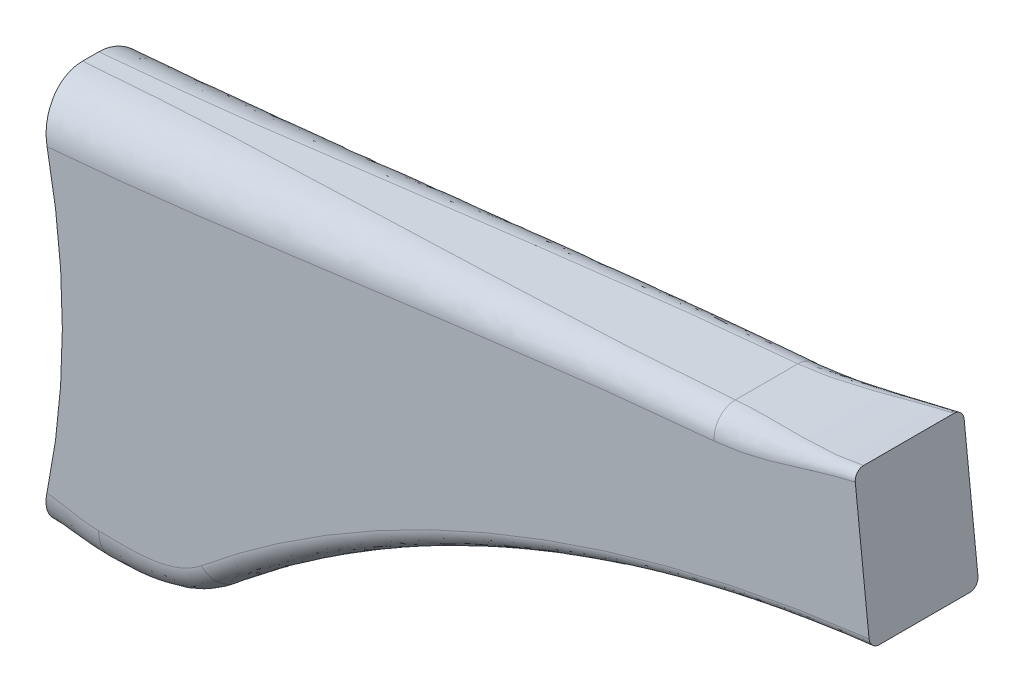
ISO-10303-21;
HEADER;
FILE_DESCRIPTION(('STEP AP214'),'2;1');
FILE_NAME('part.step','',(''),(''),'','','');
FILE_SCHEMA(('AUTOMOTIVE_DESIGN { 1 0 10303 214 1 1 1 1 }'));
ENDSEC;
DATA;
#1=APPLICATION_CONTEXT('core data for automotive mechanical design processes');
#2=APPLICATION_PROTOCOL_DEFINITION('international standard','automotive_design',2000,#1);
#3=PRODUCT_CONTEXT('',#1,'mechanical');
#4=PRODUCT('Part','Part','',(#3));
#5=PRODUCT_RELATED_PRODUCT_CATEGORY('part','',(#4));
#6=PRODUCT_DEFINITION_FORMATION('','',#4);
#7=PRODUCT_DEFINITION_CONTEXT('part definition',#1,'design');
#8=PRODUCT_DEFINITION('design','',#6,#7);
#9=PRODUCT_DEFINITION_SHAPE('','',#8);
#10=(LENGTH_UNIT() NAMED_UNIT(*) SI_UNIT(.MILLI.,.METRE.));
#11=(NAMED_UNIT(*) PLANE_ANGLE_UNIT() SI_UNIT($,.RADIAN.));
#12=(NAMED_UNIT(*) SI_UNIT($,.STERADIAN.) SOLID_ANGLE_UNIT());
#13=UNCERTAINTY_MEASURE_WITH_UNIT(LENGTH_MEASURE(1.E-05),#10,'distance_accuracy_value','');
#14=(GEOMETRIC_REPRESENTATION_CONTEXT(3) GLOBAL_UNCERTAINTY_ASSIGNED_CONTEXT((#13)) GLOBAL_UNIT_ASSIGNED_CONTEXT((#10,
#11,#12)) REPRESENTATION_CONTEXT('',''));
#15=CARTESIAN_POINT('',(0.,0.,0.));
#16=DIRECTION('',(0.,0.,1.));
#17=DIRECTION('',(1.,0.,0.));
#18=AXIS2_PLACEMENT_3D('',#15,#16,#17);
#19=CARTESIAN_POINT('',(269.867042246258,-256.86043368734,14.9225));
#20=DIRECTION('',(0.,0.,-1.));
#21=DIRECTION('',(-1.,0.,0.));
#22=AXIS2_PLACEMENT_3D('',#19,#20,#21);
#23=CYLINDRICAL_SURFACE('',#22,347.33164921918);
#24=DIRECTION('',(0.,0.,-1.));
#25=VECTOR('',#24,1.);
#26=CARTESIAN_POINT('',(49.4164553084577,11.5437638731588,14.9225));
#27=LINE('',#26,#25);
#28=CARTESIAN_POINT('',(49.4164553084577,11.5437638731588,8.57250000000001));
#29=VERTEX_POINT('',#28);
#30=CARTESIAN_POINT('',(49.4164553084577,11.5437638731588,-8.57249999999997));
#31=VERTEX_POINT('',#30);
#32=EDGE_CURVE('E427',#29,#31,#27,.T.);
#33=ORIENTED_EDGE('',*,*,#32,.T.);
#34=CARTESIAN_POINT('',(238.451888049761,89.0475925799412,-12.3825));
#35=CARTESIAN_POINT('',(229.846756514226,88.2660798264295,-12.3825));
#36=CARTESIAN_POINT('',(221.270809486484,87.1633150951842,-12.3859289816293));
#37=CARTESIAN_POINT('',(204.224998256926,84.3214175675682,-12.2368366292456));
#38=CARTESIAN_POINT('',(195.75514490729,82.5822864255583,-12.1072856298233));
#39=CARTESIAN_POINT('',(170.575445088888,76.424863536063,-11.6053292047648));
#40=CARTESIAN_POINT('',(154.096040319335,71.064840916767,-11.1196203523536));
#41=CARTESIAN_POINT('',(122.117276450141,57.9536659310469,-10.1218524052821));
#42=CARTESIAN_POINT('',(106.618181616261,50.2026219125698,-9.60979331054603));
#43=CARTESIAN_POINT('',(76.9447206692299,32.4817313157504,-8.83511710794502));
#44=CARTESIAN_POINT('',(62.7706504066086,22.5120727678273,-8.57249999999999));
#45=CARTESIAN_POINT('',(49.4164553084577,11.5437638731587,-8.57249999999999));
#46=(BOUNDED_CURVE() B_SPLINE_CURVE(3,(#34,#35,#36,#37,#38,#39,#40,#41,#42,#43,#44,#45),
.UNSPECIFIED.,.F.,.F.) B_SPLINE_CURVE_WITH_KNOTS((4,2,2,2,2,4),(4.02477176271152,
4.09940255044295,4.17403333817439,4.32329491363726,4.47255648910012,4.62181806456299),
.UNSPECIFIED.) CURVE() GEOMETRIC_REPRESENTATION_ITEM() RATIONAL_B_SPLINE_CURVE((1.,1.,1.,1.,1.,
1.,1.,1.,1.,1.,1.,1.)) REPRESENTATION_ITEM(''));
#47=CARTESIAN_POINT('',(228.6,88.011,-12.3794585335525));
#48=VERTEX_POINT('',#47);
#49=EDGE_CURVE('E52',#31,#48,#46,.F.);
#50=ORIENTED_EDGE('',*,*,#49,.T.);
#51=DIRECTION('',(0.,0.,-1.));
#52=VECTOR('',#51,1.);
#53=CARTESIAN_POINT('',(228.6,88.011,14.9225));
#54=LINE('',#53,#52);
#55=CARTESIAN_POINT('',(228.6,88.011,12.3794585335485));
#56=VERTEX_POINT('',#55);
#57=EDGE_CURVE('E177',#56,#48,#54,.T.);
#58=ORIENTED_EDGE('',*,*,#57,.F.);
#59=CARTESIAN_POINT('',(49.4164553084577,11.5437638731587,8.5725));
#60=CARTESIAN_POINT('',(62.7706504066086,22.5120727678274,8.57250000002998));
#61=CARTESIAN_POINT('',(76.9447206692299,32.4817313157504,8.83511710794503));
#62=CARTESIAN_POINT('',(106.618181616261,50.2026219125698,9.60979331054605));
#63=CARTESIAN_POINT('',(122.117276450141,57.9536659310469,10.1218524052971));
#64=CARTESIAN_POINT('',(154.096040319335,71.064840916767,11.1196203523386));
#65=CARTESIAN_POINT('',(170.575445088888,76.424863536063,11.6053292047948));
#66=CARTESIAN_POINT('',(195.75514490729,82.5822864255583,12.1072856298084));
#67=CARTESIAN_POINT('',(204.224998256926,84.3214175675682,12.2368366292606));
#68=CARTESIAN_POINT('',(221.270809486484,87.1633150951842,12.3859289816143));
#69=CARTESIAN_POINT('',(229.846756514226,88.2660798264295,12.3825));
#70=CARTESIAN_POINT('',(238.451888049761,89.0475925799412,12.3825));
#71=(BOUNDED_CURVE() B_SPLINE_CURVE(3,(#59,#60,#61,#62,#63,#64,#65,#66,#67,#68,#69,#70),
.UNSPECIFIED.,.F.,.F.) B_SPLINE_CURVE_WITH_KNOTS((4,2,2,2,2,4),(4.02477176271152,
4.17403333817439,4.32329491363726,4.47255648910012,4.54718727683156,4.62181806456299),
.UNSPECIFIED.) CURVE() GEOMETRIC_REPRESENTATION_ITEM() RATIONAL_B_SPLINE_CURVE((1.,1.,1.,1.,1.,
1.,1.,1.,1.,1.,1.,1.)) REPRESENTATION_ITEM(''));
#72=EDGE_CURVE('E382',#56,#29,#71,.F.);
#73=ORIENTED_EDGE('',*,*,#72,.T.);
#74=EDGE_LOOP('',(#33,#50,#58,#73));
#75=FACE_BOUND('',#74,.T.);
#76=ADVANCED_FACE('F32',(#75),#23,.F.);
#77=CARTESIAN_POINT('',(228.6,88.011,14.9225));
#78=DIRECTION('',(-0.994331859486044,-0.10632099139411,0.));
#79=DIRECTION('',(0.10632099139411,-0.994331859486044,0.));
#80=AXIS2_PLACEMENT_3D('',#77,#78,#79);
#81=PLANE('',#80);
#82=ORIENTED_EDGE('',*,*,#57,.T.);
#83=CARTESIAN_POINT('',(228.329603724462,90.5397916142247,-14.9225));
#84=CARTESIAN_POINT('',(228.332445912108,90.5132110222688,-14.9225001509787));
#85=CARTESIAN_POINT('',(228.33529137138,90.4866307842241,-14.9220785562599));
#86=CARTESIAN_POINT('',(228.34099426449,90.4334148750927,-14.9203903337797));
#87=CARTESIAN_POINT('',(228.343851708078,90.4067792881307,-14.9191210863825));
#88=CARTESIAN_POINT('',(228.349573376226,90.3534961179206,-14.9157318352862));
#89=CARTESIAN_POINT('',(228.352437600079,90.3268486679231,-14.9136097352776));
#90=CARTESIAN_POINT('',(228.35816757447,90.2735857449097,-14.9085122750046));
#91=CARTESIAN_POINT('',(228.361033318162,90.246970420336,-14.9055353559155));
#92=CARTESIAN_POINT('',(228.36676104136,90.1938160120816,-14.8987287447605));
#93=CARTESIAN_POINT('',(228.369623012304,90.1672770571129,-14.8948980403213));
#94=CARTESIAN_POINT('',(228.375337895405,90.1143196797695,-14.8863874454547));
#95=CARTESIAN_POINT('',(228.378190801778,90.0879013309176,-14.8817070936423));
#96=CARTESIAN_POINT('',(228.383882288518,90.035229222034,-14.8715038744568));
#97=CARTESIAN_POINT('',(228.386720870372,90.0089754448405,-14.8659810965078));
#98=CARTESIAN_POINT('',(228.392378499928,89.956676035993,-14.85410276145));
#99=CARTESIAN_POINT('',(228.395197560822,89.9306302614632,-14.84774783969));
#100=CARTESIAN_POINT('',(228.400811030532,89.8787896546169,-14.8342179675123));
#101=CARTESIAN_POINT('',(228.403605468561,89.8529945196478,-14.8270441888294));
#102=CARTESIAN_POINT('',(228.409164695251,89.8016969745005,-14.8118922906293));
#103=CARTESIAN_POINT('',(228.411929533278,89.7761940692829,-14.8039158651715));
#104=CARTESIAN_POINT('',(228.417424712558,89.7255215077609,-14.7871771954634));
#105=CARTESIAN_POINT('',(228.420155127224,89.7003511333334,-14.7784171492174));
#106=CARTESIAN_POINT('',(228.425576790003,89.6503826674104,-14.7601324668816));
#107=CARTESIAN_POINT('',(228.428268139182,89.6255836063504,-14.7506105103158));
#108=CARTESIAN_POINT('',(228.433607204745,89.5763950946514,-14.7308257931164));
#109=CARTESIAN_POINT('',(228.43625505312,89.5520043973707,-14.7205661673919));
#110=CARTESIAN_POINT('',(228.441502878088,89.5036680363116,-14.6993322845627));
#111=CARTESIAN_POINT('',(228.444103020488,89.4797208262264,-14.6883615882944));
#112=CARTESIAN_POINT('',(228.449251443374,89.4323047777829,-14.665733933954));
#113=CARTESIAN_POINT('',(228.451799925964,89.4088340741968,-14.654080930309));
#114=CARTESIAN_POINT('',(228.456841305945,89.3624021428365,-14.6301190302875));
#115=CARTESIAN_POINT('',(228.459334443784,89.3394387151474,-14.6178144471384));
#116=CARTESIAN_POINT('',(228.464261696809,89.2940500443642,-14.5925815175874));
#117=CARTESIAN_POINT('',(228.466696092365,89.2716222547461,-14.5796578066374));
#118=CARTESIAN_POINT('',(228.47150271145,89.227331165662,-14.5532203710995));
#119=CARTESIAN_POINT('',(228.473875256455,89.2054649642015,-14.5397115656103));
#120=CARTESIAN_POINT('',(228.478555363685,89.1623204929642,-14.5121387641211));
#121=CARTESIAN_POINT('',(228.480863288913,89.1410389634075,-14.4980799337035));
#122=CARTESIAN_POINT('',(228.485411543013,89.0990857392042,-14.4694439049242));
#123=CARTESIAN_POINT('',(228.487652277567,89.07841041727,-14.4548720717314));
#124=CARTESIAN_POINT('',(228.494238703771,89.0176136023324,-14.4106425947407));
#125=CARTESIAN_POINT('',(228.498512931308,88.9781284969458,-14.3800915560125));
#126=CARTESIAN_POINT('',(228.506766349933,88.9018041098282,-14.3173426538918));
#127=CARTESIAN_POINT('',(228.510749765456,88.8649274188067,-14.2851907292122));
#128=CARTESIAN_POINT('',(228.518412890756,88.7938917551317,-14.2195419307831));
#129=CARTESIAN_POINT('',(228.522097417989,88.7596902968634,-14.186091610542));
#130=CARTESIAN_POINT('',(228.529158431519,88.6940411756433,-14.1181476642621));
#131=CARTESIAN_POINT('',(228.532540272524,88.662546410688,-14.0837000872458));
#132=CARTESIAN_POINT('',(228.538996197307,88.6023080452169,-14.0140532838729));
#133=CARTESIAN_POINT('',(228.542076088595,88.5735134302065,-13.9788987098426));
#134=CARTESIAN_POINT('',(228.547932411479,88.5186392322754,-13.908115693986));
#135=CARTESIAN_POINT('',(228.550715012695,88.4925054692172,-13.8725297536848));
#136=CARTESIAN_POINT('',(228.55598460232,88.4428871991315,-13.8011437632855));
#137=CARTESIAN_POINT('',(228.558478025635,88.4193461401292,-13.7653834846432));
#138=CARTESIAN_POINT('',(228.563180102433,88.3748225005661,-13.693887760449));
#139=CARTESIAN_POINT('',(228.565395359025,88.353781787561,-13.6581889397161));
#140=CARTESIAN_POINT('',(228.569554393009,88.3141476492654,-13.5870323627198));
#141=CARTESIAN_POINT('',(228.571504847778,88.2954952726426,-13.5516078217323));
#142=CARTESIAN_POINT('',(228.575149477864,88.2605107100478,-13.4811923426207));
#143=CARTESIAN_POINT('',(228.576850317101,88.2441194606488,-13.4462310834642));
#144=CARTESIAN_POINT('',(228.580012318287,88.2135183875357,-13.376910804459));
#145=CARTESIAN_POINT('',(228.581480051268,88.1992500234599,-13.3425779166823));
#146=CARTESIAN_POINT('',(228.584193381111,88.1727481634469,-13.2746595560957));
#147=CARTESIAN_POINT('',(228.585445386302,88.1604572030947,-13.2410967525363));
#148=CARTESIAN_POINT('',(228.587745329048,88.1377592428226,-13.1748412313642));
#149=CARTESIAN_POINT('',(228.588799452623,88.1272963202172,-13.142167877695));
#150=CARTESIAN_POINT('',(228.590721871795,88.1081021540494,-13.0777927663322));
#151=CARTESIAN_POINT('',(228.591596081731,88.099316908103,-13.0461072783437));
#152=CARTESIAN_POINT('',(228.593176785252,88.083326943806,-12.9837898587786));
#153=CARTESIAN_POINT('',(228.593888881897,88.0760704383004,-12.9531713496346));
#154=CARTESIAN_POINT('',(228.595163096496,88.0629899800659,-12.8930520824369));
#155=CARTESIAN_POINT('',(228.595730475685,88.0571166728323,-12.8635621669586));
#156=CARTESIAN_POINT('',(228.596732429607,88.0466594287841,-12.8057483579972));
#157=CARTESIAN_POINT('',(228.597171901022,88.0420287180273,-12.7774330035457));
#158=CARTESIAN_POINT('',(228.597934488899,88.0339195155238,-12.7220025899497));
#159=CARTESIAN_POINT('',(228.598262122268,88.0303969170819,-12.6948940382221));
#160=CARTESIAN_POINT('',(228.598816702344,88.0243736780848,-12.6418991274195));
#161=CARTESIAN_POINT('',(228.59904777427,88.0218316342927,-12.6160175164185));
#162=CARTESIAN_POINT('',(228.599423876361,88.0176468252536,-12.5654884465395));
#163=CARTESIAN_POINT('',(228.599572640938,88.0159653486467,-12.5408442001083));
#164=CARTESIAN_POINT('',(228.59990226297,88.0121985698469,-12.4706535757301));
#165=CARTESIAN_POINT('',(228.600003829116,88.0109747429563,-12.4250593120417));
#166=CARTESIAN_POINT('',(228.60000265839,88.0109751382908,-12.3794585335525));
#167=B_SPLINE_CURVE_WITH_KNOTS('',3,(#83,#84,#85,#86,#87,#88,#89,#90,#91,#92,#93,#94,#95,#96,
#97,#98,#99,#100,#101,#102,#103,#104,#105,#106,#107,#108,#109,#110,#111,#112,#113,#114,#115,
#116,#117,#118,#119,#120,#121,#122,#123,#124,#125,#126,#127,#128,#129,#130,#131,#132,#133,#134,
#135,#136,#137,#138,#139,#140,#141,#142,#143,#144,#145,#146,#147,#148,#149,#150,#151,#152,#153,
#154,#155,#156,#157,#158,#159,#160,#161,#162,#163,#164,#165,#166),.UNSPECIFIED.,.F.,.F.,(4,2,2,
2,2,2,2,2,2,2,2,2,2,2,2,2,2,2,2,2,2,2,2,2,2,2,2,2,2,2,2,2,2,2,2,2,2,2,2,2,2,4),(0.,
0.0801930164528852,0.160635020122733,0.241275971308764,0.322064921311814,0.402950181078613,
0.483879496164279,0.564800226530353,0.645659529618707,0.726404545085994,0.806982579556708,
0.887341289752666,0.967428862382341,1.04719418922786,1.12658703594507,1.20555820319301,
1.28405967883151,1.36204478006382,1.43946828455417,1.5162865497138,1.59245761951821,
1.74268294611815,1.88986294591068,2.03373059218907,2.17405156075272,2.31062455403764,
2.44328091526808,2.57188362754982,2.6963258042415,2.81652878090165,2.93243991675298,
3.04403020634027,3.15129179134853,3.25423544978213,3.35288812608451,3.44729055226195,
3.53749499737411,3.62356317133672,3.70556429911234,3.78357337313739,3.85766958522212,
3.99444063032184),.UNSPECIFIED.);
#168=CARTESIAN_POINT('',(228.329603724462,90.5397916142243,-14.9225));
#169=VERTEX_POINT('',#168);
#170=EDGE_CURVE('E11',#48,#169,#167,.F.);
#171=ORIENTED_EDGE('',*,*,#170,.T.);
#172=DIRECTION('',(-0.10632099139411,0.994331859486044,0.));
#173=VECTOR('',#172,1.);
#174=CARTESIAN_POINT('',(228.6,88.011,-14.9225));
#175=LINE('',#174,#173);
#176=CARTESIAN_POINT('',(224.554092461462,125.849010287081,-14.9225));
#177=VERTEX_POINT('',#176);
#178=EDGE_CURVE('E482',#169,#177,#175,.T.);
#179=ORIENTED_EDGE('',*,*,#178,.T.);
#180=CARTESIAN_POINT('',(224.281999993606,128.393664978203,-12.3794408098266));
#181=CARTESIAN_POINT('',(224.281999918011,128.393665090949,-12.4045643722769));
#182=CARTESIAN_POINT('',(224.282032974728,128.393291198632,-12.4296879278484));
#183=CARTESIAN_POINT('',(224.282169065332,128.391787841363,-12.480217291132));
#184=CARTESIAN_POINT('',(224.282272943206,128.390649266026,-12.5056228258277));
#185=CARTESIAN_POINT('',(224.282556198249,128.38759106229,-12.556686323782));
#186=CARTESIAN_POINT('',(224.282736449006,128.385662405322,-12.5823437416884));
#187=CARTESIAN_POINT('',(224.283177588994,128.380999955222,-12.6338789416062));
#188=CARTESIAN_POINT('',(224.283439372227,128.378257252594,-12.6597559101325));
#189=CARTESIAN_POINT('',(224.284048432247,128.37194401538,-12.7116959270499));
#190=CARTESIAN_POINT('',(224.284396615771,128.368364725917,-12.7377579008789));
#191=CARTESIAN_POINT('',(224.285182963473,128.360357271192,-12.7900314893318));
#192=CARTESIAN_POINT('',(224.285622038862,128.355920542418,-12.8162417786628));
#193=CARTESIAN_POINT('',(224.286594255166,128.346179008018,-12.8687734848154));
#194=CARTESIAN_POINT('',(224.287128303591,128.340865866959,-12.8950933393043));
#195=CARTESIAN_POINT('',(224.28829410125,128.329354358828,-12.9478036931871));
#196=CARTESIAN_POINT('',(224.288926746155,128.323147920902,-12.9741924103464));
#197=CARTESIAN_POINT('',(224.290292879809,128.309834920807,-13.0269981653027));
#198=CARTESIAN_POINT('',(224.291027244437,128.302720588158,-13.0534132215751));
#199=CARTESIAN_POINT('',(224.292599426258,128.28757934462,-13.1062276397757));
#200=CARTESIAN_POINT('',(224.29343809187,128.279544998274,-13.1326248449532));
#201=CARTESIAN_POINT('',(224.295220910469,128.262553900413,-13.1853580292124));
#202=CARTESIAN_POINT('',(224.296165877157,128.25359008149,-13.2116917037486));
#203=CARTESIAN_POINT('',(224.298162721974,128.234733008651,-13.2642509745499));
#204=CARTESIAN_POINT('',(224.299215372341,128.224833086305,-13.2904741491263));
#205=CARTESIAN_POINT('',(224.301428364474,128.204099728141,-13.3427644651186));
#206=CARTESIAN_POINT('',(224.302589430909,128.193260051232,-13.3688291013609));
#207=CARTESIAN_POINT('',(224.305019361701,128.170646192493,-13.4207535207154));
#208=CARTESIAN_POINT('',(224.306288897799,128.158866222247,-13.4466107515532));
#209=CARTESIAN_POINT('',(224.308935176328,128.134373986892,-13.4980709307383));
#210=CARTESIAN_POINT('',(224.310312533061,128.121656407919,-13.5236713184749));
#211=CARTESIAN_POINT('',(224.313173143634,128.095294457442,-13.5745680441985));
#212=CARTESIAN_POINT('',(224.314656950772,128.081645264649,-13.5998618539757));
#213=CARTESIAN_POINT('',(224.31772842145,128.053428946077,-13.6500956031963));
#214=CARTESIAN_POINT('',(224.319316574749,128.038857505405,-13.6750330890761));
#215=CARTESIAN_POINT('',(224.322593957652,128.008808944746,-13.7245046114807));
#216=CARTESIAN_POINT('',(224.324283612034,127.993328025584,-13.7490363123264));
#217=CARTESIAN_POINT('',(224.327760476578,127.96147616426,-13.7976472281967));
#218=CARTESIAN_POINT('',(224.32954804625,127.945101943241,-13.8217242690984));
#219=CARTESIAN_POINT('',(224.333216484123,127.911482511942,-13.8693776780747));
#220=CARTESIAN_POINT('',(224.335097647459,127.894234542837,-13.8929520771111));
#221=CARTESIAN_POINT('',(224.338948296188,127.858889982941,-13.9395531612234));
#222=CARTESIAN_POINT('',(224.340918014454,127.84079114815,-13.9625781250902));
#223=CARTESIAN_POINT('',(224.344940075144,127.803770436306,-14.0080347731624));
#224=CARTESIAN_POINT('',(224.346992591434,127.78484681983,-14.0304650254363));
#225=CARTESIAN_POINT('',(224.351173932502,127.746205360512,-14.0746883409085));
#226=CARTESIAN_POINT('',(224.35330287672,127.726486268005,-14.0964803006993));
#227=CARTESIAN_POINT('',(224.357629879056,127.686285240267,-14.1393854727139));
#228=CARTESIAN_POINT('',(224.359828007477,127.665802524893,-14.160497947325));
#229=CARTESIAN_POINT('',(224.363790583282,127.628746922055,-14.1973874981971));
#230=CARTESIAN_POINT('',(224.365542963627,127.612315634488,-14.213308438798));
#231=CARTESIAN_POINT('',(224.369160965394,127.578350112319,-14.2453411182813));
#232=CARTESIAN_POINT('',(224.371028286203,127.560798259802,-14.2614339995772));
#233=CARTESIAN_POINT('',(224.374882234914,127.524561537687,-14.2937337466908));
#234=CARTESIAN_POINT('',(224.376870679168,127.505859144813,-14.3099207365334));
#235=CARTESIAN_POINT('',(224.380972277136,127.467295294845,-14.3423267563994));
#236=CARTESIAN_POINT('',(224.383087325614,127.44741652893,-14.35852495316));
#237=CARTESIAN_POINT('',(224.387446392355,127.40647895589,-14.3908662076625));
#238=CARTESIAN_POINT('',(224.389692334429,127.385403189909,-14.4069875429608));
#239=CARTESIAN_POINT('',(224.39431620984,127.342056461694,-14.4390830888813));
#240=CARTESIAN_POINT('',(224.396696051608,127.319769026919,-14.4550347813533));
#241=CARTESIAN_POINT('',(224.40158931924,127.27399046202,-14.4866946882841));
#242=CARTESIAN_POINT('',(224.404104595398,127.250483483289,-14.5023797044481));
#243=CARTESIAN_POINT('',(224.409268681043,127.202264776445,-14.5334061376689));
#244=CARTESIAN_POINT('',(224.411919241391,127.177537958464,-14.5487238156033));
#245=CARTESIAN_POINT('',(224.417352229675,127.126886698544,-14.5789124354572));
#246=CARTESIAN_POINT('',(224.420136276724,127.100948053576,-14.5937592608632));
#247=CARTESIAN_POINT('',(224.425832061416,127.047889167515,-14.6229008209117));
#248=CARTESIAN_POINT('',(224.428745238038,127.020755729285,-14.6371712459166));
#249=CARTESIAN_POINT('',(224.434695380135,126.965332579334,-14.6650537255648));
#250=CARTESIAN_POINT('',(224.437733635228,126.93703077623,-14.6786414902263));
#251=CARTESIAN_POINT('',(224.443918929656,126.87930669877,-14.705051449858));
#252=CARTESIAN_POINT('',(224.447066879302,126.849873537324,-14.7178495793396));
#253=CARTESIAN_POINT('',(224.455381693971,126.7722638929,-14.7498656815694));
#254=CARTESIAN_POINT('',(224.460597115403,126.723715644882,-14.7681789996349));
#255=CARTESIAN_POINT('',(224.470691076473,126.630135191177,-14.8002519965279));
#256=CARTESIAN_POINT('',(224.475556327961,126.585191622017,-14.8142758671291));
#257=CARTESIAN_POINT('',(224.484876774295,126.499104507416,-14.8385398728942));
#258=CARTESIAN_POINT('',(224.489324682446,126.458027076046,-14.8490175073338));
#259=CARTESIAN_POINT('',(224.497777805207,126.379843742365,-14.866892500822));
#260=CARTESIAN_POINT('',(224.501779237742,126.342785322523,-14.8744998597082));
#261=CARTESIAN_POINT('',(224.509322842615,126.272719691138,-14.8872623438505));
#262=CARTESIAN_POINT('',(224.512863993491,126.239745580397,-14.8926002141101));
#263=CARTESIAN_POINT('',(224.519485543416,126.17786427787,-14.9013717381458));
#264=CARTESIAN_POINT('',(224.522566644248,126.148979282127,-14.9049619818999));
#265=CARTESIAN_POINT('',(224.528274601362,126.095248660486,-14.9107070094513));
#266=CARTESIAN_POINT('',(224.53090328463,126.070417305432,-14.9129937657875));
#267=CARTESIAN_POINT('',(224.535721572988,126.02474234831,-14.9165248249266));
#268=CARTESIAN_POINT('',(224.537913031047,126.003907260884,-14.9178782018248));
#269=CARTESIAN_POINT('',(224.543229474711,125.953128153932,-14.9205505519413));
#270=CARTESIAN_POINT('',(224.546345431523,125.923168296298,-14.9215979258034));
#271=CARTESIAN_POINT('',(224.551008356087,125.878471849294,-14.9223723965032));
#272=CARTESIAN_POINT('',(224.552547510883,125.863740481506,-14.9225000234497));
#273=CARTESIAN_POINT('',(224.554092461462,125.849010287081,-14.9225));
#274=B_SPLINE_CURVE_WITH_KNOTS('',3,(#180,#181,#182,#183,#184,#185,#186,#187,#188,#189,#190,
#191,#192,#193,#194,#195,#196,#197,#198,#199,#200,#201,#202,#203,#204,#205,#206,#207,#208,#209,
#210,#211,#212,#213,#214,#215,#216,#217,#218,#219,#220,#221,#222,#223,#224,#225,#226,#227,#228,
#229,#230,#231,#232,#233,#234,#235,#236,#237,#238,#239,#240,#241,#242,#243,#244,#245,#246,#247,
#248,#249,#250,#251,#252,#253,#254,#255,#256,#257,#258,#259,#260,#261,#262,#263,#264,#265,#266,
#267,#268,#269,#270,#271,#272,#273),.UNSPECIFIED.,.F.,.F.,(4,2,2,2,2,2,2,2,2,2,2,2,2,2,2,2,2,2,
2,2,2,2,2,2,2,2,2,2,2,2,2,2,2,2,2,2,2,2,2,2,2,2,2,2,2,2,4),(0.,0.075367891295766,
0.151650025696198,0.228829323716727,0.306886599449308,0.385800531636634,0.465547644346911,
0.546102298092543,0.627436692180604,0.709520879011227,0.792322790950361,0.875808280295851,
0.959941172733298,1.04468333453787,1.12999475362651,1.21583363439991,1.3021565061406,
1.38891834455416,1.47607270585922,1.56357187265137,1.65136701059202,1.73940833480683,
1.82764528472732,1.91602670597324,2.00450103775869,2.07333216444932,2.14498025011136,
2.21941280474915,2.29659033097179,2.37646580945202,2.45898422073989,2.54408211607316,
2.63168725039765,2.72171829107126,2.81408461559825,2.90868621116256,3.00541368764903,
3.16175581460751,3.30367989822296,3.43150287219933,3.54559222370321,3.64633807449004,
3.73413081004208,3.80934362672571,3.87231924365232,3.96271735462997,4.00715119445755),.UNSPECIFIED.);
#275=CARTESIAN_POINT('',(224.282,128.393664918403,-12.3794408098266));
#276=VERTEX_POINT('',#275);
#277=EDGE_CURVE('E150',#177,#276,#274,.F.);
#278=ORIENTED_EDGE('',*,*,#277,.T.);
#279=DIRECTION('',(0.,0.,-1.));
#280=VECTOR('',#279,1.);
#281=CARTESIAN_POINT('',(224.282,128.393664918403,14.9225));
#282=LINE('',#281,#280);
#283=CARTESIAN_POINT('',(224.282,128.393664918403,12.3794408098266));
#284=VERTEX_POINT('',#283);
#285=EDGE_CURVE('E163',#284,#276,#282,.T.);
#286=ORIENTED_EDGE('',*,*,#285,.F.);
#287=CARTESIAN_POINT('',(224.554092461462,125.849010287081,14.9225));
#288=CARTESIAN_POINT('',(224.552580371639,125.863439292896,14.9225000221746));
#289=CARTESIAN_POINT('',(224.551073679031,125.877869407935,14.9223775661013));
#290=CARTESIAN_POINT('',(224.546459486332,125.92212350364,14.9216264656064));
#291=CARTESIAN_POINT('',(224.543359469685,125.951942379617,14.920597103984));
#292=CARTESIAN_POINT('',(224.538060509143,126.002571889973,14.9179591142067));
#293=CARTESIAN_POINT('',(224.53587060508,126.023397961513,14.9166173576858));
#294=CARTESIAN_POINT('',(224.531050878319,126.069097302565,14.9131089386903));
#295=CARTESIAN_POINT('',(224.528419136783,126.09396201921,14.9108320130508));
#296=CARTESIAN_POINT('',(224.522700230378,126.147803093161,14.9051021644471));
#297=CARTESIAN_POINT('',(224.519611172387,126.176765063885,14.9015156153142));
#298=CARTESIAN_POINT('',(224.512968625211,126.238845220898,14.8927416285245));
#299=CARTESIAN_POINT('',(224.509414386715,126.271940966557,14.8873954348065));
#300=CARTESIAN_POINT('',(224.501839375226,126.342295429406,14.8745994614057));
#301=CARTESIAN_POINT('',(224.497819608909,126.379520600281,14.8669642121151));
#302=CARTESIAN_POINT('',(224.489324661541,126.458082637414,14.8490079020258));
#303=CARTESIAN_POINT('',(224.484853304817,126.499371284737,14.8384735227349));
#304=CARTESIAN_POINT('',(224.475481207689,126.585923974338,14.814060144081));
#305=CARTESIAN_POINT('',(224.470587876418,126.631120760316,14.7999397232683));
#306=CARTESIAN_POINT('',(224.460434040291,126.725246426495,14.7676259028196));
#307=CARTESIAN_POINT('',(224.455187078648,126.774085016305,14.7491638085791));
#308=CARTESIAN_POINT('',(224.446846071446,126.851938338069,14.7169657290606));
#309=CARTESIAN_POINT('',(224.443702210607,126.881333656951,14.7041534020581));
#310=CARTESIAN_POINT('',(224.437524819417,126.938984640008,14.6777169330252));
#311=CARTESIAN_POINT('',(224.434490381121,126.967251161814,14.6641167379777));
#312=CARTESIAN_POINT('',(224.428547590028,127.022606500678,14.6362108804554));
#313=CARTESIAN_POINT('',(224.425637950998,127.049707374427,14.6219293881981));
#314=CARTESIAN_POINT('',(224.419948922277,127.102704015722,14.5927667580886));
#315=CARTESIAN_POINT('',(224.417168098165,127.128612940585,14.5779098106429));
#316=CARTESIAN_POINT('',(224.411741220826,127.179207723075,14.5477015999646));
#317=CARTESIAN_POINT('',(224.40909355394,127.203907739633,14.5323743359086));
#318=CARTESIAN_POINT('',(224.403934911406,127.252075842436,14.5013289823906));
#319=CARTESIAN_POINT('',(224.401422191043,127.27555897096,14.4856345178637));
#320=CARTESIAN_POINT('',(224.396533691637,127.321292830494,14.4539555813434));
#321=CARTESIAN_POINT('',(224.394156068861,127.343559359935,14.4379941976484));
#322=CARTESIAN_POINT('',(224.389536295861,127.386867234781,14.4058787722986));
#323=CARTESIAN_POINT('',(224.38729224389,127.40792500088,14.389747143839));
#324=CARTESIAN_POINT('',(224.382936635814,127.448829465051,14.3573844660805));
#325=CARTESIAN_POINT('',(224.380823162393,127.468693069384,14.3411750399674));
#326=CARTESIAN_POINT('',(224.376724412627,127.507229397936,14.3087454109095));
#327=CARTESIAN_POINT('',(224.374737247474,127.525919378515,14.2925459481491));
#328=CARTESIAN_POINT('',(224.370885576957,127.562133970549,14.2602198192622));
#329=CARTESIAN_POINT('',(224.369019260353,127.579676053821,14.2441129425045));
#330=CARTESIAN_POINT('',(224.365403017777,127.613624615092,14.2120505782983));
#331=CARTESIAN_POINT('',(224.363651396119,127.630048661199,14.1961138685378));
#332=CARTESIAN_POINT('',(224.359693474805,127.667060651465,14.1592147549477));
#333=CARTESIAN_POINT('',(224.357499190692,127.687507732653,14.1381094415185));
#334=CARTESIAN_POINT('',(224.353179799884,127.727638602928,14.0952204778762));
#335=CARTESIAN_POINT('',(224.351054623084,127.747323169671,14.0734375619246));
#336=CARTESIAN_POINT('',(224.346880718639,127.785896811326,14.0292341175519));
#337=CARTESIAN_POINT('',(224.34483187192,127.804787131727,14.0068146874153));
#338=CARTESIAN_POINT('',(224.340817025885,127.841742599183,13.9613813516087));
#339=CARTESIAN_POINT('',(224.338850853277,127.859809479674,13.9383688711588));
#340=CARTESIAN_POINT('',(224.335007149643,127.895091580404,13.8917942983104));
#341=CARTESIAN_POINT('',(224.333129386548,127.912309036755,13.8682339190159));
#342=CARTESIAN_POINT('',(224.329467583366,127.945868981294,13.820609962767));
#343=CARTESIAN_POINT('',(224.327683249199,127.962214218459,13.7965483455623));
#344=CARTESIAN_POINT('',(224.324212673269,127.994009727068,13.7479695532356));
#345=CARTESIAN_POINT('',(224.322526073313,128.009463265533,13.7234545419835));
#346=CARTESIAN_POINT('',(224.319254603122,128.039458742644,13.6740175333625));
#347=CARTESIAN_POINT('',(224.317669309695,128.054004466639,13.6490978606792));
#348=CARTESIAN_POINT('',(224.314603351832,128.082171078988,13.598900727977));
#349=CARTESIAN_POINT('',(224.31312219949,128.095796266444,13.5736257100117));
#350=CARTESIAN_POINT('',(224.310266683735,128.122111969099,13.5227674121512));
#351=CARTESIAN_POINT('',(224.308891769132,128.134807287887,13.4971866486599));
#352=CARTESIAN_POINT('',(224.306250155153,128.159256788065,13.4457664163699));
#353=CARTESIAN_POINT('',(224.304982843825,128.171016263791,13.4199294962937));
#354=CARTESIAN_POINT('',(224.302557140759,128.193590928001,13.3680462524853));
#355=CARTESIAN_POINT('',(224.301398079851,128.204411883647,13.3420024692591));
#356=CARTESIAN_POINT('',(224.299188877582,128.225109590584,13.2897542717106));
#357=CARTESIAN_POINT('',(224.298138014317,128.234992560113,13.263552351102));
#358=CARTESIAN_POINT('',(224.296144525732,128.253817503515,13.2110358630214));
#359=CARTESIAN_POINT('',(224.295201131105,128.26276612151,13.1847237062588));
#360=CARTESIAN_POINT('',(224.293421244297,128.279728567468,13.1320336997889));
#361=CARTESIAN_POINT('',(224.292583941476,128.287749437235,13.1056581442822));
#362=CARTESIAN_POINT('',(224.291014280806,128.302865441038,13.0528870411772));
#363=CARTESIAN_POINT('',(224.290281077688,128.309967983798,13.0264936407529));
#364=CARTESIAN_POINT('',(224.288917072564,128.323259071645,12.9737310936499));
#365=CARTESIAN_POINT('',(224.288285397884,128.329455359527,12.9473639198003));
#366=CARTESIAN_POINT('',(224.287121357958,128.340948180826,12.8946964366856));
#367=CARTESIAN_POINT('',(224.28658810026,128.346252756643,12.8683979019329));
#368=CARTESIAN_POINT('',(224.285617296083,128.355978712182,12.8159085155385));
#369=CARTESIAN_POINT('',(224.285178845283,128.360408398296,12.7897192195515));
#370=CARTESIAN_POINT('',(224.284393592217,128.368403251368,12.7374872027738));
#371=CARTESIAN_POINT('',(224.284045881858,128.371976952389,12.7114458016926));
#372=CARTESIAN_POINT('',(224.283437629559,128.378280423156,12.6595464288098));
#373=CARTESIAN_POINT('',(224.283176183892,128.381018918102,12.6336895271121));
#374=CARTESIAN_POINT('',(224.282735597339,128.385674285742,12.5821938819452));
#375=CARTESIAN_POINT('',(224.282555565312,128.3876000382,12.5565559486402));
#376=CARTESIAN_POINT('',(224.282272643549,128.390653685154,12.5055307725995));
#377=CARTESIAN_POINT('',(224.282168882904,128.391790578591,12.4801440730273));
#378=CARTESIAN_POINT('',(224.282032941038,128.393291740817,12.4296516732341));
#379=CARTESIAN_POINT('',(224.281999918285,128.393665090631,12.4045462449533));
#380=CARTESIAN_POINT('',(224.281999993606,128.393664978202,12.3794408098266));
#381=B_SPLINE_CURVE_WITH_KNOTS('',3,(#287,#288,#289,#290,#291,#292,#293,#294,#295,#296,#297,
#298,#299,#300,#301,#302,#303,#304,#305,#306,#307,#308,#309,#310,#311,#312,#313,#314,#315,#316,
#317,#318,#319,#320,#321,#322,#323,#324,#325,#326,#327,#328,#329,#330,#331,#332,#333,#334,#335,
#336,#337,#338,#339,#340,#341,#342,#343,#344,#345,#346,#347,#348,#349,#350,#351,#352,#353,#354,
#355,#356,#357,#358,#359,#360,#361,#362,#363,#364,#365,#366,#367,#368,#369,#370,#371,#372,#373,
#374,#375,#376,#377,#378,#379,#380),.UNSPECIFIED.,.F.,.F.,(4,2,2,2,2,2,2,2,2,2,2,2,2,2,2,2,2,2,
2,2,2,2,2,2,2,2,2,2,2,2,2,2,2,2,2,2,2,2,2,2,2,2,2,2,2,2,4),(0.,0.0435249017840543,
0.133496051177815,0.196442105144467,0.271752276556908,0.359773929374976,0.460885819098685,
0.575484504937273,0.703966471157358,0.846705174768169,1.00402236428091,1.10066207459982,
1.19518373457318,1.28747844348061,1.37744662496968,1.46499804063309,1.55005169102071,
1.63253561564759,1.71238660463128,1.78954983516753,1.86397844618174,1.9356330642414,
2.00448129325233,2.0928652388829,2.18115653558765,2.26930378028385,2.35725597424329,
2.44496270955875,2.53237435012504,2.61944220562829,2.70611869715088,2.79235751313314,
2.87811375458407,2.96334406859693,3.0480067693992,3.13206194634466,3.21547155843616,
3.2981995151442,3.38021174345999,3.46147624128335,3.54196311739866,3.62164461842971,
3.7004951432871,3.77849124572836,3.85561162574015,3.93183711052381,4.00715062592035),.UNSPECIFIED.);
#382=CARTESIAN_POINT('',(224.554092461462,125.849010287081,14.9225));
#383=VERTEX_POINT('',#382);
#384=EDGE_CURVE('E175',#284,#383,#381,.F.);
#385=ORIENTED_EDGE('',*,*,#384,.T.);
#386=DIRECTION('',(-0.10632099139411,0.994331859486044,0.));
#387=VECTOR('',#386,1.);
#388=CARTESIAN_POINT('',(228.6,88.011,14.9225));
#389=LINE('',#388,#387);
#390=CARTESIAN_POINT('',(228.329603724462,90.5397916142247,14.9225));
#391=VERTEX_POINT('',#390);
#392=EDGE_CURVE('E497',#391,#383,#389,.T.);
#393=ORIENTED_EDGE('',*,*,#392,.F.);
#394=CARTESIAN_POINT('',(228.60000265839,88.0109751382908,12.3794585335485));
#395=CARTESIAN_POINT('',(228.600003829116,88.0109747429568,12.4250593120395));
#396=CARTESIAN_POINT('',(228.59990226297,88.0121985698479,12.4706535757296));
#397=CARTESIAN_POINT('',(228.599572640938,88.0159653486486,12.5408442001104));
#398=CARTESIAN_POINT('',(228.599423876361,88.0176468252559,12.5654884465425));
#399=CARTESIAN_POINT('',(228.59904777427,88.0218316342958,12.6160175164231));
#400=CARTESIAN_POINT('',(228.598816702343,88.0243736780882,12.6418991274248));
#401=CARTESIAN_POINT('',(228.598262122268,88.0303969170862,12.6948940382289));
#402=CARTESIAN_POINT('',(228.597934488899,88.0339195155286,12.7220025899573));
#403=CARTESIAN_POINT('',(228.597171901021,88.042028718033,12.7774330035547));
#404=CARTESIAN_POINT('',(228.596732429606,88.0466594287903,12.8057483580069));
#405=CARTESIAN_POINT('',(228.595730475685,88.0571166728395,12.8635621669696));
#406=CARTESIAN_POINT('',(228.595163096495,88.0629899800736,12.8930520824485));
#407=CARTESIAN_POINT('',(228.593888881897,88.0760704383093,12.9531713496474));
#408=CARTESIAN_POINT('',(228.593176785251,88.0833269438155,12.983789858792));
#409=CARTESIAN_POINT('',(228.59159608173,88.0993169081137,13.0461072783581));
#410=CARTESIAN_POINT('',(228.590721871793,88.1081021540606,13.0777927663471));
#411=CARTESIAN_POINT('',(228.588799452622,88.1272963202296,13.1421678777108));
#412=CARTESIAN_POINT('',(228.587745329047,88.1377592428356,13.1748412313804));
#413=CARTESIAN_POINT('',(228.5854453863,88.160457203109,13.2410967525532));
#414=CARTESIAN_POINT('',(228.58419338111,88.1727481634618,13.274659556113));
#415=CARTESIAN_POINT('',(228.581480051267,88.1992500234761,13.3425779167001));
#416=CARTESIAN_POINT('',(228.580012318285,88.2135183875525,13.3769108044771));
#417=CARTESIAN_POINT('',(228.5768503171,88.244119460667,13.4462310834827));
#418=CARTESIAN_POINT('',(228.575149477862,88.2605107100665,13.4811923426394));
#419=CARTESIAN_POINT('',(228.571504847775,88.2954952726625,13.5516078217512));
#420=CARTESIAN_POINT('',(228.569554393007,88.314147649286,13.5870323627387));
#421=CARTESIAN_POINT('',(228.565395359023,88.3537817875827,13.6581889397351));
#422=CARTESIAN_POINT('',(228.563180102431,88.3748225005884,13.693887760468));
#423=CARTESIAN_POINT('',(228.558478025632,88.4193461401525,13.7653834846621));
#424=CARTESIAN_POINT('',(228.555984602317,88.4428871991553,13.8011437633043));
#425=CARTESIAN_POINT('',(228.550715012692,88.492505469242,13.8725297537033));
#426=CARTESIAN_POINT('',(228.547932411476,88.5186392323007,13.9081156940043));
#427=CARTESIAN_POINT('',(228.542076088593,88.5735134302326,13.9788987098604));
#428=CARTESIAN_POINT('',(228.538996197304,88.6023080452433,14.0140532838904));
#429=CARTESIAN_POINT('',(228.532540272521,88.662546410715,14.0837000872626));
#430=CARTESIAN_POINT('',(228.529158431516,88.6940411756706,14.1181476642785));
#431=CARTESIAN_POINT('',(228.522097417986,88.759690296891,14.1860916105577));
#432=CARTESIAN_POINT('',(228.518412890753,88.7938917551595,14.2195419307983));
#433=CARTESIAN_POINT('',(228.510749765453,88.8649274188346,14.2851907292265));
#434=CARTESIAN_POINT('',(228.50676634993,88.9018041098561,14.3173426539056));
#435=CARTESIAN_POINT('',(228.498512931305,88.9781284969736,14.3800915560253));
#436=CARTESIAN_POINT('',(228.494238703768,89.0176136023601,14.410642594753));
#437=CARTESIAN_POINT('',(228.487652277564,89.0784104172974,14.4548720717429));
#438=CARTESIAN_POINT('',(228.48541154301,89.0990857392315,14.4694439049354));
#439=CARTESIAN_POINT('',(228.48086328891,89.1410389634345,14.4980799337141));
#440=CARTESIAN_POINT('',(228.478555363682,89.162320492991,14.5121387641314));
#441=CARTESIAN_POINT('',(228.473875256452,89.2054649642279,14.5397115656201));
#442=CARTESIAN_POINT('',(228.471502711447,89.2273311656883,14.5532203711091));
#443=CARTESIAN_POINT('',(228.466696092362,89.2716222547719,14.5796578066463));
#444=CARTESIAN_POINT('',(228.464261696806,89.2940500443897,14.592581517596));
#445=CARTESIAN_POINT('',(228.459334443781,89.3394387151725,14.6178144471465));
#446=CARTESIAN_POINT('',(228.456841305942,89.3624021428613,14.6301190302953));
#447=CARTESIAN_POINT('',(228.451799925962,89.408834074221,14.6540809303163));
#448=CARTESIAN_POINT('',(228.449251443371,89.4323047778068,14.665733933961));
#449=CARTESIAN_POINT('',(228.444103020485,89.4797208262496,14.6883615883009));
#450=CARTESIAN_POINT('',(228.441502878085,89.5036680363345,14.6993322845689));
#451=CARTESIAN_POINT('',(228.436255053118,89.5520043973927,14.7205661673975));
#452=CARTESIAN_POINT('',(228.433607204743,89.5763950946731,14.7308257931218));
#453=CARTESIAN_POINT('',(228.42826813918,89.6255836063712,14.7506105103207));
#454=CARTESIAN_POINT('',(228.425576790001,89.6503826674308,14.7601324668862));
#455=CARTESIAN_POINT('',(228.420155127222,89.700351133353,14.7784171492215));
#456=CARTESIAN_POINT('',(228.417424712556,89.72552150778,14.7871771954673));
#457=CARTESIAN_POINT('',(228.411929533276,89.776194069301,14.803915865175));
#458=CARTESIAN_POINT('',(228.40916469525,89.8016969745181,14.8118922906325));
#459=CARTESIAN_POINT('',(228.403605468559,89.8529945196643,14.8270441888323));
#460=CARTESIAN_POINT('',(228.400811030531,89.8787896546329,14.8342179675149));
#461=CARTESIAN_POINT('',(228.39519756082,89.9306302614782,14.8477478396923));
#462=CARTESIAN_POINT('',(228.392378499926,89.9566760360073,14.8541027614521));
#463=CARTESIAN_POINT('',(228.386720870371,90.0089754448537,14.8659810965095));
#464=CARTESIAN_POINT('',(228.383882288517,90.0352292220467,14.8715038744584));
#465=CARTESIAN_POINT('',(228.378190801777,90.0879013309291,14.8817070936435));
#466=CARTESIAN_POINT('',(228.375337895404,90.1143196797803,14.8863874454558));
#467=CARTESIAN_POINT('',(228.369623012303,90.1672770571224,14.8948980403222));
#468=CARTESIAN_POINT('',(228.366761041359,90.1938160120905,14.8987287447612));
#469=CARTESIAN_POINT('',(228.361033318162,90.2469704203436,14.905535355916));
#470=CARTESIAN_POINT('',(228.358167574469,90.2735857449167,14.908512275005));
#471=CARTESIAN_POINT('',(228.352437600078,90.3268486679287,14.9136097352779));
#472=CARTESIAN_POINT('',(228.349573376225,90.3534961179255,14.9157318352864));
#473=CARTESIAN_POINT('',(228.343851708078,90.4067792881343,14.9191210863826));
#474=CARTESIAN_POINT('',(228.34099426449,90.4334148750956,14.9203903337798));
#475=CARTESIAN_POINT('',(228.33529137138,90.4866307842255,14.9220785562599));
#476=CARTESIAN_POINT('',(228.332445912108,90.5132110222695,14.9225001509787));
#477=CARTESIAN_POINT('',(228.329603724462,90.5397916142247,14.9225));
#478=B_SPLINE_CURVE_WITH_KNOTS('',3,(#394,#395,#396,#397,#398,#399,#400,#401,#402,#403,#404,
#405,#406,#407,#408,#409,#410,#411,#412,#413,#414,#415,#416,#417,#418,#419,#420,#421,#422,#423,
#424,#425,#426,#427,#428,#429,#430,#431,#432,#433,#434,#435,#436,#437,#438,#439,#440,#441,#442,
#443,#444,#445,#446,#447,#448,#449,#450,#451,#452,#453,#454,#455,#456,#457,#458,#459,#460,#461,
#462,#463,#464,#465,#466,#467,#468,#469,#470,#471,#472,#473,#474,#475,#476,#477),.UNSPECIFIED.,
.F.,.F.,(4,2,2,2,2,2,2,2,2,2,2,2,2,2,2,2,2,2,2,2,2,2,2,2,2,2,2,2,2,2,2,2,2,2,2,2,2,2,2,2,2,4),
(0.,0.136771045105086,0.210867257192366,0.288876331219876,0.370877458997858,0.456945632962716,
0.547150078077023,0.641552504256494,0.740205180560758,0.843148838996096,0.950410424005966,
1.06200071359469,1.17791184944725,1.29811482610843,1.42255700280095,1.55115971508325,
1.68381607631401,1.82038906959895,1.96071003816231,2.10457768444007,2.25175768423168,
2.40198301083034,2.47815408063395,2.55497234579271,2.63239585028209,2.71038095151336,
2.78888242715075,2.86785359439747,2.94724644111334,3.02701176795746,3.10709934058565,
3.18745805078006,3.26803608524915,3.34878110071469,3.42964040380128,3.51056113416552,
3.59149044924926,3.67237570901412,3.75316465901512,3.83380561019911,3.91424761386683,
3.99444063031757),.UNSPECIFIED.);
#479=EDGE_CURVE('E45',#391,#56,#478,.F.);
#480=ORIENTED_EDGE('',*,*,#479,.T.);
#481=EDGE_LOOP('',(#82,#171,#179,#278,#286,#385,#393,#480));
#482=FACE_BOUND('',#481,.T.);
#483=ADVANCED_FACE('F615',(#482),#81,.F.);
#484=CARTESIAN_POINT('',(160.276689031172,424.144075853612,14.9225));
#485=DIRECTION('',(0.,0.,-1.));
#486=DIRECTION('',(-1.,0.,0.));
#487=AXIS2_PLACEMENT_3D('',#484,#485,#486);
#488=CYLINDRICAL_SURFACE('',#487,302.59706773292);
#489=ORIENTED_EDGE('',*,*,#285,.T.);
#490=CARTESIAN_POINT('',(185.341529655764,122.586885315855,-8.57249999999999));
#491=CARTESIAN_POINT('',(186.97966772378,122.723022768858,-8.57253793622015));
#492=CARTESIAN_POINT('',(188.614788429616,122.87239534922,-8.6321957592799));
#493=CARTESIAN_POINT('',(191.882412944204,123.197641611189,-8.84056714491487));
#494=CARTESIAN_POINT('',(193.5148905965,123.37360057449,-8.98957204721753));
#495=CARTESIAN_POINT('',(196.776062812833,123.751868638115,-9.34673012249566));
#496=CARTESIAN_POINT('',(198.404719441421,123.95427530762,-9.55510585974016));
#497=CARTESIAN_POINT('',(201.658353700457,124.385443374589,-10.0014384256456));
#498=CARTESIAN_POINT('',(203.283313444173,124.614266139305,-10.2394642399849));
#499=CARTESIAN_POINT('',(206.529297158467,125.098301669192,-10.7155357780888));
#500=CARTESIAN_POINT('',(208.150321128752,125.353514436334,-10.9535815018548));
#501=CARTESIAN_POINT('',(211.388199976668,125.890350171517,-11.3998742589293));
#502=CARTESIAN_POINT('',(213.005055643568,126.171909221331,-11.6081904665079));
#503=CARTESIAN_POINT('',(216.234703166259,126.761548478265,-11.9655070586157));
#504=CARTESIAN_POINT('',(217.847487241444,127.069524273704,-12.1147289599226));
#505=CARTESIAN_POINT('',(221.067826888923,127.711766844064,-12.3225069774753));
#506=CARTESIAN_POINT('',(222.675382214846,128.045943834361,-12.3813596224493));
#507=CARTESIAN_POINT('',(224.281999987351,128.393664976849,-12.3794408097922));
#508=B_SPLINE_CURVE_WITH_KNOTS('',3,(#490,#491,#492,#493,#494,#495,#496,#497,#498,#499,#500,
#501,#502,#503,#504,#505,#506,#507),.UNSPECIFIED.,.F.,.F.,(4,2,2,2,2,2,2,2,4),(0.,
4.927524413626,9.87120436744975,14.8336662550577,19.80789766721,24.7821294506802,
29.7445916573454,34.6882717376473,39.6156951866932),.UNSPECIFIED.);
#509=CARTESIAN_POINT('',(185.341529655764,122.586885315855,-8.57249999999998));
#510=VERTEX_POINT('',#509);
#511=EDGE_CURVE('E161',#276,#510,#508,.F.);
#512=ORIENTED_EDGE('',*,*,#511,.T.);
#513=DIRECTION('',(0.,0.,-1.));
#514=VECTOR('',#513,1.);
#515=CARTESIAN_POINT('',(185.341529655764,122.586885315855,14.9225));
#516=LINE('',#515,#514);
#517=CARTESIAN_POINT('',(185.341529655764,122.586885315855,8.57250000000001));
#518=VERTEX_POINT('',#517);
#519=EDGE_CURVE('E144',#518,#510,#516,.T.);
#520=ORIENTED_EDGE('',*,*,#519,.F.);
#521=CARTESIAN_POINT('',(224.281999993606,128.393664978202,12.379440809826));
#522=CARTESIAN_POINT('',(222.67538222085,128.045943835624,12.3813596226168));
#523=CARTESIAN_POINT('',(221.067826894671,127.711766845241,12.3225069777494));
#524=CARTESIAN_POINT('',(217.847487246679,127.069524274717,12.1147289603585));
#525=CARTESIAN_POINT('',(216.234703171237,126.7615484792,11.9655070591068));
#526=CARTESIAN_POINT('',(213.00505564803,126.171909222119,11.6081904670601));
#527=CARTESIAN_POINT('',(211.388199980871,125.890350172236,11.3998742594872));
#528=CARTESIAN_POINT('',(208.150321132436,125.353514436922,10.9535815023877));
#529=CARTESIAN_POINT('',(206.529297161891,125.09830166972,10.7155357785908));
#530=CARTESIAN_POINT('',(203.283313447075,124.61426613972,10.2394642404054));
#531=CARTESIAN_POINT('',(201.658353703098,124.385443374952,10.0014384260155));
#532=CARTESIAN_POINT('',(198.404719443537,123.954275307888,9.55510586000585));
#533=CARTESIAN_POINT('',(196.776062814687,123.751868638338,9.34673012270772));
#534=CARTESIAN_POINT('',(193.514890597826,123.373600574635,8.98957204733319));
#535=CARTESIAN_POINT('',(191.882412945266,123.197641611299,8.84056714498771));
#536=CARTESIAN_POINT('',(188.614788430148,122.872395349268,8.63219575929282));
#537=CARTESIAN_POINT('',(186.979667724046,122.72302276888,8.57253793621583));
#538=CARTESIAN_POINT('',(185.341529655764,122.586885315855,8.5724999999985));
#539=B_SPLINE_CURVE_WITH_KNOTS('',3,(#521,#522,#523,#524,#525,#526,#527,#528,#529,#530,#531,
#532,#533,#534,#535,#536,#537,#538),.UNSPECIFIED.,.F.,.F.,(4,2,2,2,2,2,2,2,4),(0.,
4.92742344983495,9.87110353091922,14.8335657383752,19.8077975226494,24.7820289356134,
29.7444908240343,34.6881707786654,39.6156951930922),.UNSPECIFIED.);
#540=EDGE_CURVE('E157',#518,#284,#539,.F.);
#541=ORIENTED_EDGE('',*,*,#540,.T.);
#542=EDGE_LOOP('',(#489,#512,#520,#541));
#543=FACE_BOUND('',#542,.T.);
#544=ADVANCED_FACE('F156',(#543),#488,.F.);
#545=CARTESIAN_POINT('',(185.341529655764,122.586885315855,14.9225));
#546=DIRECTION('',(0.0828323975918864,-0.996563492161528,0.));
#547=DIRECTION('',(0.996563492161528,0.0828323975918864,0.));
#548=AXIS2_PLACEMENT_3D('',#545,#546,#547);
#549=PLANE('',#548);
#550=ORIENTED_EDGE('',*,*,#519,.T.);
#551=CARTESIAN_POINT('',(185.341529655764,122.586885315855,-8.5725));
#552=CARTESIAN_POINT('',(123.582161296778,117.453568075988,-8.5725));
#553=CARTESIAN_POINT('',(61.8227929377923,112.32025083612,-2.2225));
#554=CARTESIAN_POINT('',(0.0634245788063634,107.186933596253,-2.2225));
#555=CARTESIAN_POINT('',(-123.455312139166,96.9202991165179,-2.2225));
#556=CARTESIAN_POINT('',(-246.974048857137,86.6536646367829,-2.2225));
#557=CARTESIAN_POINT('',(-370.492785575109,76.387030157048,-2.2225));
#558=(BOUNDED_CURVE() B_SPLINE_CURVE(3,(#551,#552,#553,#554,#555,#556,#557),.UNSPECIFIED.,.F.,
.F.) B_SPLINE_CURVE_WITH_KNOTS((4,3,4),(0.,0.185917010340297,0.557751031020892),
.UNSPECIFIED.) CURVE() GEOMETRIC_REPRESENTATION_ITEM() RATIONAL_B_SPLINE_CURVE((1.,1.,1.,1.,1.,
1.,1.)) REPRESENTATION_ITEM(''));
#559=CARTESIAN_POINT('',(0.0634245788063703,107.186933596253,-2.22249999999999));
#560=VERTEX_POINT('',#559);
#561=EDGE_CURVE('E149',#510,#560,#558,.T.);
#562=ORIENTED_EDGE('',*,*,#561,.T.);
#563=DIRECTION('',(0.,0.,-1.));
#564=VECTOR('',#563,1.);
#565=CARTESIAN_POINT('',(0.0634245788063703,107.186933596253,14.9225));
#566=LINE('',#565,#564);
#567=CARTESIAN_POINT('',(0.0634245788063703,107.186933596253,2.22250000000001));
#568=VERTEX_POINT('',#567);
#569=EDGE_CURVE('E146',#568,#560,#566,.T.);
#570=ORIENTED_EDGE('',*,*,#569,.F.);
#571=CARTESIAN_POINT('',(185.341529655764,122.586885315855,8.5725));
#572=CARTESIAN_POINT('',(123.582161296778,117.453568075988,8.5725));
#573=CARTESIAN_POINT('',(61.8227929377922,112.32025083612,2.2225));
#574=CARTESIAN_POINT('',(0.0634245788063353,107.186933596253,2.2225));
#575=CARTESIAN_POINT('',(-123.455312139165,96.9202991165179,2.2225));
#576=CARTESIAN_POINT('',(-246.974048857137,86.653664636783,2.2225));
#577=CARTESIAN_POINT('',(-370.492785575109,76.3870301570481,2.2225));
#578=(BOUNDED_CURVE() B_SPLINE_CURVE(3,(#571,#572,#573,#574,#575,#576,#577),.UNSPECIFIED.,.F.,
.F.) B_SPLINE_CURVE_WITH_KNOTS((4,3,4),(0.,0.185917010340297,0.557751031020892),
.UNSPECIFIED.) CURVE() GEOMETRIC_REPRESENTATION_ITEM() RATIONAL_B_SPLINE_CURVE((1.,1.,1.,1.,1.,
1.,1.)) REPRESENTATION_ITEM(''));
#579=EDGE_CURVE('E141',#568,#518,#578,.F.);
#580=ORIENTED_EDGE('',*,*,#579,.T.);
#581=EDGE_LOOP('',(#550,#562,#570,#580));
#582=FACE_BOUND('',#581,.T.);
#583=ADVANCED_FACE('F143',(#582),#549,.F.);
#584=CARTESIAN_POINT('',(-195.973302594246,53.7094467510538,14.9225));
#585=DIRECTION('',(0.,0.,-1.));
#586=DIRECTION('',(-1.,0.,0.));
#587=AXIS2_PLACEMENT_3D('',#584,#585,#586);
#588=CYLINDRICAL_SURFACE('',#587,203.2);
#589=DIRECTION('',(0.,0.,-1.));
#590=VECTOR('',#589,1.);
#591=CARTESIAN_POINT('',(0.,0.,14.9225));
#592=LINE('',#591,#590);
#593=CARTESIAN_POINT('',(0.,0.,2.22250000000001));
#594=VERTEX_POINT('',#593);
#595=CARTESIAN_POINT('',(0.,0.,-2.2225));
#596=VERTEX_POINT('',#595);
#597=EDGE_CURVE('E415',#594,#596,#592,.T.);
#598=ORIENTED_EDGE('',*,*,#597,.F.);
#599=CARTESIAN_POINT('',(0.,0.,2.2225));
#600=CARTESIAN_POINT('',(-3.94750692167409E-07,-2.19211598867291E-07,2.39652223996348));
#601=CARTESIAN_POINT('',(0.00098049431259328,0.00357744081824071,2.57052285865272));
#602=CARTESIAN_POINT('',(0.00489849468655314,0.017875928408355,2.91820682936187));
#603=CARTESIAN_POINT('',(0.00783558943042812,0.0285966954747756,3.09189018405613));
#604=CARTESIAN_POINT('',(0.0195687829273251,0.0714442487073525,3.61192893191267));
#605=CARTESIAN_POINT('',(0.0312868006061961,0.114256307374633,3.95740269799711));
#606=CARTESIAN_POINT('',(0.0623184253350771,0.227873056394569,4.64257376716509));
#607=CARTESIAN_POINT('',(0.0816160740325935,0.298618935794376,4.9822816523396));
#608=CARTESIAN_POINT('',(0.127540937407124,0.467481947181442,5.65432931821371));
#609=CARTESIAN_POINT('',(0.154168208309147,0.565599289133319,5.98666904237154));
#610=CARTESIAN_POINT('',(0.214388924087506,0.788345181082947,6.64165662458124));
#611=CARTESIAN_POINT('',(0.247981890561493,0.912971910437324,6.9643051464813));
#612=CARTESIAN_POINT('',(0.321694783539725,1.18769680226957,7.59780521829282));
#613=CARTESIAN_POINT('',(0.361814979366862,1.33779601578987,7.90865628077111));
#614=CARTESIAN_POINT('',(0.448082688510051,1.66227991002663,8.51661010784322));
#615=CARTESIAN_POINT('',(0.494231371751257,1.83666930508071,8.81371018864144));
#616=CARTESIAN_POINT('',(0.591993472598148,2.20836620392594,9.39225790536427));
#617=CARTESIAN_POINT('',(0.643606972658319,2.40567405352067,9.67370530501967));
#618=CARTESIAN_POINT('',(0.753034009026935,2.82686654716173,10.2259451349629));
#619=CARTESIAN_POINT('',(0.810968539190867,3.05128422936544,10.4963070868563));
#620=CARTESIAN_POINT('',(0.931313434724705,3.52109160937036,11.0172297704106));
#621=CARTESIAN_POINT('',(0.993725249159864,3.76648810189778,11.2677840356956));
#622=CARTESIAN_POINT('',(1.12235161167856,4.27654004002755,11.7475080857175));
#623=CARTESIAN_POINT('',(1.1885669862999,4.54119967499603,11.9766731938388));
#624=CARTESIAN_POINT('',(1.32411473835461,5.08796549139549,12.4121339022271));
#625=CARTESIAN_POINT('',(1.39344719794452,5.37007213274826,12.6184288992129));
#626=CARTESIAN_POINT('',(1.53689207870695,5.9594940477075,13.0132421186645));
#627=CARTESIAN_POINT('',(1.61108674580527,6.26733432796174,13.2009474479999));
#628=CARTESIAN_POINT('',(1.76132980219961,6.89748205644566,13.5491118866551));
#629=CARTESIAN_POINT('',(1.83737758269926,7.21978478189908,13.7095798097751));
#630=CARTESIAN_POINT('',(1.99059910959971,7.87662859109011,14.0020186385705));
#631=CARTESIAN_POINT('',(2.06777225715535,8.2111632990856,14.1340041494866));
#632=CARTESIAN_POINT('',(2.22254853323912,8.89018766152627,14.3684058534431));
#633=CARTESIAN_POINT('',(2.30015155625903,9.23467495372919,14.4708290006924));
#634=CARTESIAN_POINT('',(2.48467910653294,10.0641535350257,14.6783335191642));
#635=CARTESIAN_POINT('',(2.59152621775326,10.5527362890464,14.7696003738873));
#636=CARTESIAN_POINT('',(2.75008500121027,11.2910678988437,14.8611548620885));
#637=CARTESIAN_POINT('',(2.80264366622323,11.5380447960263,14.8841153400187));
#638=CARTESIAN_POINT('',(2.90704250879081,12.0331657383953,14.9147885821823));
#639=CARTESIAN_POINT('',(2.95888248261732,12.2813100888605,14.9224971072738));
#640=CARTESIAN_POINT('',(3.01027126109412,12.5296296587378,14.9225));
#641=B_SPLINE_CURVE_WITH_KNOTS('',3,(#599,#600,#601,#602,#603,#604,#605,#606,#607,#608,#609,
#610,#611,#612,#613,#614,#615,#616,#617,#618,#619,#620,#621,#622,#623,#624,#625,#626,#627,#628,
#629,#630,#631,#632,#633,#634,#635,#636,#637,#638,#639,#640),.UNSPECIFIED.,.F.,.F.,(4,2,2,2,2,2,
2,2,2,2,2,2,2,2,2,2,2,2,2,2,4),(0.,0.521984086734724,1.04396375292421,2.08753529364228,
3.12892134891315,4.17031539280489,5.211637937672,6.25300345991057,7.29457137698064,
8.3361550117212,9.40327843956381,10.4707488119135,11.5384520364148,12.6061834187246,
13.7092044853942,14.8118679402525,15.9139646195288,17.0158018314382,18.536845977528,
19.2971049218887,20.0575751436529),.UNSPECIFIED.);
#642=CARTESIAN_POINT('',(3.0102712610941,12.5296296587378,14.9225));
#643=VERTEX_POINT('',#642);
#644=EDGE_CURVE('E262',#594,#643,#641,.T.);
#645=ORIENTED_EDGE('',*,*,#644,.T.);
#646=CARTESIAN_POINT('',(-195.973302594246,53.7094467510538,14.9225));
#647=DIRECTION('',(0.,0.,-1.));
#648=DIRECTION('',(-1.,0.,0.));
#649=AXIS2_PLACEMENT_3D('',#646,#647,#648);
#650=CIRCLE('',#649,203.2);
#651=CARTESIAN_POINT('',(3.05068312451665,94.6935059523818,14.9225));
#652=VERTEX_POINT('',#651);
#653=EDGE_CURVE('E495',#652,#643,#650,.T.);
#654=ORIENTED_EDGE('',*,*,#653,.F.);
#655=CARTESIAN_POINT('',(3.05068312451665,94.6935059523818,14.9225));
#656=CARTESIAN_POINT('',(2.97759832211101,95.0484636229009,14.9225369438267));
#657=CARTESIAN_POINT('',(2.9035473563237,95.4032114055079,14.9072019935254));
#658=CARTESIAN_POINT('',(2.7541038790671,96.1097679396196,14.8461203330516));
#659=CARTESIAN_POINT('',(2.67871146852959,96.4615769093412,14.8003759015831));
#660=CARTESIAN_POINT('',(2.52722164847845,97.159528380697,14.6788528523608));
#661=CARTESIAN_POINT('',(2.45112481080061,97.50567493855,14.6030968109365));
#662=CARTESIAN_POINT('',(2.29880784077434,98.1901513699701,14.4221312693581));
#663=CARTESIAN_POINT('',(2.22258770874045,98.5284812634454,14.3169218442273));
#664=CARTESIAN_POINT('',(2.07061204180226,99.1953234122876,14.0776778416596));
#665=CARTESIAN_POINT('',(1.99485708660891,99.5238248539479,13.9436127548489));
#666=CARTESIAN_POINT('',(1.84459368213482,100.168347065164,13.6476686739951));
#667=CARTESIAN_POINT('',(1.77008523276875,100.484367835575,13.4857896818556));
#668=CARTESIAN_POINT('',(1.6230433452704,101.10169035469,13.1353594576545));
#669=CARTESIAN_POINT('',(1.55050967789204,101.402993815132,12.9468113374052));
#670=CARTESIAN_POINT('',(1.40814006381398,101.988810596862,12.5443233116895));
#671=CARTESIAN_POINT('',(1.33830410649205,102.273323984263,12.3303835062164));
#672=CARTESIAN_POINT('',(1.20193625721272,102.824066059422,11.878153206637));
#673=CARTESIAN_POINT('',(1.13541075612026,103.09025973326,11.6398181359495));
#674=CARTESIAN_POINT('',(1.00653245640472,103.601872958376,11.1407654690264));
#675=CARTESIAN_POINT('',(0.944179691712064,103.847292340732,10.8800476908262));
#676=CARTESIAN_POINT('',(0.824346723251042,104.315609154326,10.3379875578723));
#677=CARTESIAN_POINT('',(0.766867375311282,104.538502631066,10.0566415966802));
#678=CARTESIAN_POINT('',(0.657472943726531,104.960061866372,9.47533910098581));
#679=CARTESIAN_POINT('',(0.60555771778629,105.158728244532,9.17538304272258));
#680=CARTESIAN_POINT('',(0.508339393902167,105.528754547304,8.56160668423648));
#681=CARTESIAN_POINT('',(0.462983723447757,105.700332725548,8.24792630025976));
#682=CARTESIAN_POINT('',(0.378923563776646,106.016904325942,7.60657351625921));
#683=CARTESIAN_POINT('',(0.340219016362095,106.16189798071,7.2789012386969));
#684=CARTESIAN_POINT('',(0.269974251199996,106.424100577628,6.61210959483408));
#685=CARTESIAN_POINT('',(0.238429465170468,106.541327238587,6.27299768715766));
#686=CARTESIAN_POINT('',(0.182889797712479,106.74716464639,5.58574018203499));
#687=CARTESIAN_POINT('',(0.158892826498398,106.835783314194,5.23759711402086));
#688=CARTESIAN_POINT('',(0.113850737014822,107.001825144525,4.44870226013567));
#689=CARTESIAN_POINT('',(0.0949569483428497,107.071231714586,4.00609361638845));
#690=CARTESIAN_POINT('',(0.0760490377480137,107.140638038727,3.33885625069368));
#691=CARTESIAN_POINT('',(0.0713185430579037,107.157989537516,3.1160131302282));
#692=CARTESIAN_POINT('',(0.0650056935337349,107.181138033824,2.66963024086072));
#693=CARTESIAN_POINT('',(0.0634240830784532,107.186932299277,2.44609031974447));
#694=CARTESIAN_POINT('',(0.0634245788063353,107.186933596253,2.2225));
#695=B_SPLINE_CURVE_WITH_KNOTS('',3,(#655,#656,#657,#658,#659,#660,#661,#662,#663,#664,#665,
#666,#667,#668,#669,#670,#671,#672,#673,#674,#675,#676,#677,#678,#679,#680,#681,#682,#683,#684,
#685,#686,#687,#688,#689,#690,#691,#692,#693,#694),.UNSPECIFIED.,.F.,.F.,(4,2,2,2,2,2,2,2,2,2,2,
2,2,2,2,2,2,2,2,4),(0.,1.08686973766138,2.17365804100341,3.25963035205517,4.34559989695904,
5.43272333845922,6.51984670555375,7.60684332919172,8.69383567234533,9.78285094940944,
10.8718750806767,11.9610900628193,13.0502771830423,14.1301833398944,15.2100800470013,
16.2892857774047,17.3681924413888,18.7105284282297,19.3809597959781,20.0515496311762),.UNSPECIFIED.);
#696=EDGE_CURVE('E223',#652,#568,#695,.T.);
#697=ORIENTED_EDGE('',*,*,#696,.T.);
#698=ORIENTED_EDGE('',*,*,#569,.T.);
#699=CARTESIAN_POINT('',(0.0634245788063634,107.186933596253,-2.2225));
#700=CARTESIAN_POINT('',(0.0634066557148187,107.186973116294,-2.57431984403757));
#701=CARTESIAN_POINT('',(0.0673369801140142,107.172590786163,-2.92613134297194));
#702=CARTESIAN_POINT('',(0.0829640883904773,107.115269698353,-3.62721547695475));
#703=CARTESIAN_POINT('',(0.0946601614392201,107.072333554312,-3.97648834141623));
#704=CARTESIAN_POINT('',(0.125668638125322,106.958266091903,-4.66958822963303));
#705=CARTESIAN_POINT('',(0.144971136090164,106.8871714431,-5.01342173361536));
#706=CARTESIAN_POINT('',(0.190942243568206,106.717340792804,-5.69368677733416));
#707=CARTESIAN_POINT('',(0.217610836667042,106.618604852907,-6.0301183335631));
#708=CARTESIAN_POINT('',(0.278020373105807,106.394090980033,-6.69365188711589));
#709=CARTESIAN_POINT('',(0.311770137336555,106.268279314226,-7.020741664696));
#710=CARTESIAN_POINT('',(0.385907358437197,105.990622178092,-7.66289921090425));
#711=CARTESIAN_POINT('',(0.426294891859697,105.838776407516,-7.97796684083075));
#712=CARTESIAN_POINT('',(0.513222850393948,105.510162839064,-8.59393099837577));
#713=CARTESIAN_POINT('',(0.559763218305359,105.333395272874,-8.89482765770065));
#714=CARTESIAN_POINT('',(0.658454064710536,104.956205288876,-9.4804362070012));
#715=CARTESIAN_POINT('',(0.710604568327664,104.755782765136,-9.76514802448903));
#716=CARTESIAN_POINT('',(0.82057207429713,104.33019101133,-10.3197641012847));
#717=CARTESIAN_POINT('',(0.878448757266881,104.104757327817,-10.5894536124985));
#718=CARTESIAN_POINT('',(0.998693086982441,103.632710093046,-11.1085315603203));
#719=CARTESIAN_POINT('',(1.06106078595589,103.38609629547,-11.3579197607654));
#720=CARTESIAN_POINT('',(1.18962692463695,102.873346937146,-11.8347945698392));
#721=CARTESIAN_POINT('',(1.25582625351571,102.607206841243,-12.0622760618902));
#722=CARTESIAN_POINT('',(1.39135104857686,102.05728717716,-12.4937674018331));
#723=CARTESIAN_POINT('',(1.46067649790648,101.77350770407,-12.6977773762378));
#724=CARTESIAN_POINT('',(1.60278107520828,101.186007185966,-13.0837577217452));
#725=CARTESIAN_POINT('',(1.67559567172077,100.88205692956,-13.2653662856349));
#726=CARTESIAN_POINT('',(1.82300540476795,100.260093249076,-13.6018053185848));
#727=CARTESIAN_POINT('',(1.89760057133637,99.9420795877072,-13.7566353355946));
#728=CARTESIAN_POINT('',(2.04783585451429,99.2943034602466,-14.0383907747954));
#729=CARTESIAN_POINT('',(2.12347553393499,98.964545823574,-14.1653275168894));
#730=CARTESIAN_POINT('',(2.27511255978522,98.2955841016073,-14.3904537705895));
#731=CARTESIAN_POINT('',(2.35110982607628,97.9563820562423,-14.4886494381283));
#732=CARTESIAN_POINT('',(2.53261011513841,97.1361768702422,-14.6883613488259));
#733=CARTESIAN_POINT('',(2.6380073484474,96.6516860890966,-14.7761048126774));
#734=CARTESIAN_POINT('',(2.79433265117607,95.9199858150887,-14.8638954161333));
#735=CARTESIAN_POINT('',(2.84612303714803,95.6753698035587,-14.8858548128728));
#736=CARTESIAN_POINT('',(2.94898458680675,95.1850594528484,-14.9151569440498));
#737=CARTESIAN_POINT('',(3.00005559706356,94.9393648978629,-14.9224966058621));
#738=CARTESIAN_POINT('',(3.05068312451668,94.6935059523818,-14.9225));
#739=B_SPLINE_CURVE_WITH_KNOTS('',3,(#699,#700,#701,#702,#703,#704,#705,#706,#707,#708,#709,
#710,#711,#712,#713,#714,#715,#716,#717,#718,#719,#720,#721,#722,#723,#724,#725,#726,#727,#728,
#729,#730,#731,#732,#733,#734,#735,#736,#737,#738),.UNSPECIFIED.,.F.,.F.,(4,2,2,2,2,2,2,2,2,2,2,
2,2,2,2,2,2,2,2,4),(0.,1.0551314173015,2.11016626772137,3.1638316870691,4.21749475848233,
5.2724782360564,6.32747388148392,7.38245971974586,8.43745028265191,9.50490813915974,
10.5723784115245,11.6400974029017,12.7078106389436,13.7909805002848,14.8741686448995,
15.9569163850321,17.0394320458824,18.5460778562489,19.298722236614,20.0515247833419),.UNSPECIFIED.);
#740=CARTESIAN_POINT('',(3.05068312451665,94.6935059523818,-14.9225));
#741=VERTEX_POINT('',#740);
#742=EDGE_CURVE('E231',#560,#741,#739,.T.);
#743=ORIENTED_EDGE('',*,*,#742,.T.);
#744=CARTESIAN_POINT('',(-195.973302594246,53.7094467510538,-14.9225));
#745=DIRECTION('',(0.,0.,-1.));
#746=DIRECTION('',(-1.,0.,0.));
#747=AXIS2_PLACEMENT_3D('',#744,#745,#746);
#748=CIRCLE('',#747,203.2);
#749=CARTESIAN_POINT('',(3.0102712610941,12.5296296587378,-14.9225));
#750=VERTEX_POINT('',#749);
#751=EDGE_CURVE('E492',#741,#750,#748,.T.);
#752=ORIENTED_EDGE('',*,*,#751,.T.);
#753=CARTESIAN_POINT('',(3.0102712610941,12.5296296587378,-14.9225));
#754=CARTESIAN_POINT('',(2.93717868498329,12.1763932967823,-14.9225374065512));
#755=CARTESIAN_POINT('',(2.86313430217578,11.8233921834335,-14.9069036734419));
#756=CARTESIAN_POINT('',(2.71375320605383,11.1204591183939,-14.844921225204));
#757=CARTESIAN_POINT('',(2.63841681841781,10.7705264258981,-14.7985801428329));
#758=CARTESIAN_POINT('',(2.48715242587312,10.0767303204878,-14.6759121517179));
#759=CARTESIAN_POINT('',(2.41122561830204,9.732857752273,-14.5996354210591));
#760=CARTESIAN_POINT('',(2.25927627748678,9.05291345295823,-14.4179323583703));
#761=CARTESIAN_POINT('',(2.18325373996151,8.71684208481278,-14.3125046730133));
#762=CARTESIAN_POINT('',(2.03181198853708,8.05498584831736,-14.0735539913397));
#763=CARTESIAN_POINT('',(1.95639238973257,7.72919394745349,-13.9400507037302));
#764=CARTESIAN_POINT('',(1.80673603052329,7.08966323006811,-13.6459420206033));
#765=CARTESIAN_POINT('',(1.73249968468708,6.77592858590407,-13.4853273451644));
#766=CARTESIAN_POINT('',(1.58589960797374,6.16261652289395,-13.1381916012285));
#767=CARTESIAN_POINT('',(1.51353614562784,5.86304112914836,-12.9516668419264));
#768=CARTESIAN_POINT('',(1.37137791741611,5.28004333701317,-12.5540116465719));
#769=CARTESIAN_POINT('',(1.30158319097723,4.99662118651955,-12.3428808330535));
#770=CARTESIAN_POINT('',(1.16356527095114,4.44100557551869,-11.8918667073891));
#771=CARTESIAN_POINT('',(1.09542394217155,4.16926472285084,-11.6514003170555));
#772=CARTESIAN_POINT('',(0.963340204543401,3.64677272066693,-11.1477619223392));
#773=CARTESIAN_POINT('',(0.899396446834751,3.39601482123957,-10.8845972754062));
#774=CARTESIAN_POINT('',(0.776411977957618,2.91721365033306,-10.3371586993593));
#775=CARTESIAN_POINT('',(0.717372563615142,2.68917638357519,-10.0528792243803));
#776=CARTESIAN_POINT('',(0.604947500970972,2.25770908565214,-9.46517754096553));
#777=CARTESIAN_POINT('',(0.551561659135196,2.05427821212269,-9.16175598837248));
#778=CARTESIAN_POINT('',(0.451565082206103,1.67532857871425,-8.540471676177));
#779=CARTESIAN_POINT('',(0.404900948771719,1.49958865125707,-8.22275247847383));
#780=CARTESIAN_POINT('',(0.318452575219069,1.17550539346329,-7.5727496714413));
#781=CARTESIAN_POINT('',(0.278668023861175,1.02716082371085,-7.24046672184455));
#782=CARTESIAN_POINT('',(0.206572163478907,0.759319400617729,-6.56398201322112));
#783=CARTESIAN_POINT('',(0.174254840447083,0.639799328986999,-6.21979010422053));
#784=CARTESIAN_POINT('',(0.117539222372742,0.43061908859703,-5.52196816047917));
#785=CARTESIAN_POINT('',(0.093138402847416,0.340949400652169,-5.16834117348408));
#786=CARTESIAN_POINT('',(0.0487493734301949,0.178112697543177,-4.3860283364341));
#787=CARTESIAN_POINT('',(0.030487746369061,0.111345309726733,-3.95587902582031));
#788=CARTESIAN_POINT('',(0.0122082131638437,0.0445606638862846,-3.30744626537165));
#789=CARTESIAN_POINT('',(0.00763386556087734,0.0278602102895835,-3.09086855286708));
#790=CARTESIAN_POINT('',(0.00152902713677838,0.00557865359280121,-2.65704295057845));
#791=CARTESIAN_POINT('',(-6.75949496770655E-07,4.28124159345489E-07,-2.43979490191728));
#792=CARTESIAN_POINT('',(0.,0.,-2.2225));
#793=B_SPLINE_CURVE_WITH_KNOTS('',3,(#753,#754,#755,#756,#757,#758,#759,#760,#761,#762,#763,
#764,#765,#766,#767,#768,#769,#770,#771,#772,#773,#774,#775,#776,#777,#778,#779,#780,#781,#782,
#783,#784,#785,#786,#787,#788,#789,#790,#791,#792),.UNSPECIFIED.,.F.,.F.,(4,2,2,2,2,2,2,2,2,2,2,
2,2,2,2,2,2,2,2,4),(0.,1.08176359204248,2.16325839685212,3.24294809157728,4.32268791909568,
5.4016722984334,6.48102675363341,7.56053511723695,8.64006004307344,9.74634951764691,
10.8522817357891,11.9585054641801,13.0646913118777,14.1615373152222,15.258333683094,
16.3542436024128,17.4498037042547,18.7541054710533,19.4056513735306,20.0573658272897),.UNSPECIFIED.);
#794=EDGE_CURVE('E255',#750,#596,#793,.T.);
#795=ORIENTED_EDGE('',*,*,#794,.T.);
#796=EDGE_LOOP('',(#598,#645,#654,#697,#698,#743,#752,#795));
#797=FACE_BOUND('',#796,.T.);
#798=ADVANCED_FACE('F241',(#797),#588,.F.);
#799=CARTESIAN_POINT('',(0.,0.,14.9225));
#800=DIRECTION('',(0.,1.,0.));
#801=DIRECTION('',(0.,0.,1.));
#802=AXIS2_PLACEMENT_3D('',#799,#800,#801);
#803=PLANE('',#802);
#804=DIRECTION('',(0.,0.,-1.));
#805=VECTOR('',#804,1.);
#806=CARTESIAN_POINT('',(17.1738138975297,0.,14.9225));
#807=LINE('',#806,#805);
#808=CARTESIAN_POINT('',(17.1738138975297,0.,4.31547001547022));
#809=VERTEX_POINT('',#808);
#810=CARTESIAN_POINT('',(17.1738138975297,0.,-4.31547001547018));
#811=VERTEX_POINT('',#810);
#812=EDGE_CURVE('E418',#809,#811,#807,.T.);
#813=ORIENTED_EDGE('',*,*,#812,.F.);
#814=CARTESIAN_POINT('',(-34.3476277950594,0.,2.2225));
#815=CARTESIAN_POINT('',(-22.8984185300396,0.,2.2225));
#816=CARTESIAN_POINT('',(-11.4492092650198,0.,2.2225));
#817=CARTESIAN_POINT('',(0.,0.,2.2225));
#818=CARTESIAN_POINT('',(5.72460463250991,0.,2.2225));
#819=CARTESIAN_POINT('',(11.4492092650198,0.,4.31547001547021));
#820=CARTESIAN_POINT('',(17.1738138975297,0.,4.31547001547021));
#821=(BOUNDED_CURVE() B_SPLINE_CURVE(3,(#814,#815,#816,#817,#818,#819,#820),.UNSPECIFIED.,.F.,
.F.) B_SPLINE_CURVE_WITH_KNOTS((4,3,4),(-0.0343476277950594,0.,0.0171738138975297),
.UNSPECIFIED.) CURVE() GEOMETRIC_REPRESENTATION_ITEM() RATIONAL_B_SPLINE_CURVE((1.,1.,1.,1.,1.,
1.,1.)) REPRESENTATION_ITEM(''));
#822=EDGE_CURVE('E263',#809,#594,#821,.F.);
#823=ORIENTED_EDGE('',*,*,#822,.T.);
#824=ORIENTED_EDGE('',*,*,#597,.T.);
#825=CARTESIAN_POINT('',(-34.3476277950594,0.,-2.2225));
#826=CARTESIAN_POINT('',(-22.8984185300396,0.,-2.2225));
#827=CARTESIAN_POINT('',(-11.4492092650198,0.,-2.2225));
#828=CARTESIAN_POINT('',(0.,0.,-2.2225));
#829=CARTESIAN_POINT('',(5.7246046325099,0.,-2.2225));
#830=CARTESIAN_POINT('',(11.4492092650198,0.,-4.31547001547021));
#831=CARTESIAN_POINT('',(17.1738138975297,0.,-4.31547001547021));
#832=(BOUNDED_CURVE() B_SPLINE_CURVE(3,(#825,#826,#827,#828,#829,#830,#831),.UNSPECIFIED.,.F.,
.F.) B_SPLINE_CURVE_WITH_KNOTS((4,3,4),(-0.0343476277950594,0.,0.0171738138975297),
.UNSPECIFIED.) CURVE() GEOMETRIC_REPRESENTATION_ITEM() RATIONAL_B_SPLINE_CURVE((1.,1.,1.,1.,1.,
1.,1.)) REPRESENTATION_ITEM(''));
#833=EDGE_CURVE('E451',#596,#811,#832,.T.);
#834=ORIENTED_EDGE('',*,*,#833,.T.);
#835=EDGE_LOOP('',(#813,#823,#824,#834));
#836=FACE_BOUND('',#835,.T.);
#837=ADVANCED_FACE('F246',(#836),#803,.F.);
#838=CARTESIAN_POINT('',(17.1738138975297,50.8,14.9225));
#839=DIRECTION('',(0.,0.,-1.));
#840=DIRECTION('',(-1.,0.,0.));
#841=AXIS2_PLACEMENT_3D('',#838,#839,#840);
#842=CYLINDRICAL_SURFACE('',#841,50.8);
#843=ORIENTED_EDGE('',*,*,#32,.F.);
#844=CARTESIAN_POINT('',(17.1738138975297,0.,4.3154700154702));
#845=CARTESIAN_POINT('',(17.9018800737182,-2.64742482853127E-05,4.31545260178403));
#846=CARTESIAN_POINT('',(18.6297433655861,0.0156886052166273,4.33211455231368));
#847=CARTESIAN_POINT('',(20.0841295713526,0.0783034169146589,4.39449440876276));
#848=CARTESIAN_POINT('',(20.81064821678,0.12525518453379,4.44026079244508));
#849=CARTESIAN_POINT('',(22.2609148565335,0.250210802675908,4.55667432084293));
#850=CARTESIAN_POINT('',(22.9846501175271,0.328297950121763,4.62738814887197));
#851=CARTESIAN_POINT('',(24.4280682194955,0.515376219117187,4.78952588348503));
#852=CARTESIAN_POINT('',(25.1477313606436,0.624463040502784,4.88101374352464));
#853=CARTESIAN_POINT('',(26.5816710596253,0.873419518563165,5.08055303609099));
#854=CARTESIAN_POINT('',(27.295924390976,1.01338236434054,5.18865430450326));
#855=CARTESIAN_POINT('',(28.7177543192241,1.32375526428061,5.41728100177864));
#856=CARTESIAN_POINT('',(29.4253085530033,1.4942440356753,5.53783820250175));
#857=CARTESIAN_POINT('',(30.8324517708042,1.86534621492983,5.78723960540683));
#858=CARTESIAN_POINT('',(31.5320231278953,2.0660160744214,5.91609907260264));
#859=CARTESIAN_POINT('',(32.9219085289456,2.49716568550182,6.17796470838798));
#860=CARTESIAN_POINT('',(33.6122127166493,2.72767476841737,6.31097485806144));
#861=CARTESIAN_POINT('',(34.9822603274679,3.21818998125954,6.57699515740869));
#862=CARTESIAN_POINT('',(35.6620037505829,3.47819611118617,6.71000530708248));
#863=CARTESIAN_POINT('',(37.009702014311,4.02717771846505,6.97187094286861));
#864=CARTESIAN_POINT('',(37.6776678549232,4.3161242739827,7.10073041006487));
#865=CARTESIAN_POINT('',(39.0005903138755,4.92246166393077,7.35013181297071));
#866=CARTESIAN_POINT('',(39.6555691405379,5.23979768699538,7.47068901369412));
#867=CARTESIAN_POINT('',(40.9512961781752,5.9023858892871,7.69931571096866));
#868=CARTESIAN_POINT('',(41.592077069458,6.24756304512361,7.80741697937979));
#869=CARTESIAN_POINT('',(42.8581812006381,6.96529747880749,8.00695627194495));
#870=CARTESIAN_POINT('',(43.4835456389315,7.33776800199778,8.09844413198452));
#871=CARTESIAN_POINT('',(44.7177003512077,8.10933539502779,8.2605818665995));
#872=CARTESIAN_POINT('',(45.326536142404,8.50834580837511,8.33129569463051));
#873=CARTESIAN_POINT('',(46.5265540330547,9.33226588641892,8.44770922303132));
#874=CARTESIAN_POINT('',(47.1177791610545,9.75710310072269,8.49347560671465));
#875=CARTESIAN_POINT('',(48.281412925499,10.631812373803,8.55585546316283));
#876=CARTESIAN_POINT('',(48.8538512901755,11.081641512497,8.57251741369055));
#877=CARTESIAN_POINT('',(49.4164553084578,11.5437638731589,8.5725));
#878=B_SPLINE_CURVE_WITH_KNOTS('',3,(#844,#845,#846,#847,#848,#849,#850,#851,#852,#853,#854,
#855,#856,#857,#858,#859,#860,#861,#862,#863,#864,#865,#866,#867,#868,#869,#870,#871,#872,#873,
#874,#875,#876,#877),.UNSPECIFIED.,.F.,.F.,(4,2,2,2,2,2,2,2,2,2,2,2,2,2,2,2,4),(0.,
2.1835446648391,4.370735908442,6.56381826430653,8.763745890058,10.9704063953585,
13.1828413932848,15.3994672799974,17.6182888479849,19.837110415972,22.053736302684,
24.2661713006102,26.4728318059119,28.6727594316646,30.8658417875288,33.0530330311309,
35.2365776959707),.UNSPECIFIED.);
#879=EDGE_CURVE('E458',#29,#809,#878,.F.);
#880=ORIENTED_EDGE('',*,*,#879,.T.);
#881=ORIENTED_EDGE('',*,*,#812,.T.);
#882=CARTESIAN_POINT('',(49.4164553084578,11.5437638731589,-8.57249999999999));
#883=CARTESIAN_POINT('',(47.1670016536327,9.69620193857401,-8.57249999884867));
#884=CARTESIAN_POINT('',(44.7584199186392,8.04251031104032,-8.30643562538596));
#885=CARTESIAN_POINT('',(39.693772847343,5.17144684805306,-7.50824250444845));
#886=CARTESIAN_POINT('',(37.0377961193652,3.95412905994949,-6.97611375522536));
#887=CARTESIAN_POINT('',(31.5566769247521,1.99173568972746,-5.91185626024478));
#888=CARTESIAN_POINT('',(28.7316141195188,1.24668862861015,-5.37972751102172));
#889=CARTESIAN_POINT('',(22.9955973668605,0.250813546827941,-4.58153439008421));
#890=CARTESIAN_POINT('',(20.0847461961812,0.,-4.31547001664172));
#891=CARTESIAN_POINT('',(17.1738138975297,0.,-4.3154700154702));
#892=(BOUNDED_CURVE() B_SPLINE_CURVE(3,(#882,#883,#884,#885,#886,#887,#888,#889,#890,#891),
.UNSPECIFIED.,.F.,.F.) B_SPLINE_CURVE_WITH_KNOTS((4,2,2,2,4),(4.71238898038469,4.88429328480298,
5.05619758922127,5.22810189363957,5.40000619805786),
.UNSPECIFIED.) CURVE() GEOMETRIC_REPRESENTATION_ITEM() RATIONAL_B_SPLINE_CURVE((1.,1.,1.,1.,1.,
1.,1.,1.,1.,1.)) REPRESENTATION_ITEM(''));
#893=EDGE_CURVE('E353',#811,#31,#892,.F.);
#894=ORIENTED_EDGE('',*,*,#893,.T.);
#895=EDGE_LOOP('',(#843,#880,#881,#894));
#896=FACE_BOUND('',#895,.T.);
#897=ADVANCED_FACE('F435',(#896),#842,.T.);
#898=CARTESIAN_POINT('',(269.867042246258,-256.86043368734,14.9225));
#899=DIRECTION('',(0.,0.,1.));
#900=DIRECTION('',(1.,0.,0.));
#901=AXIS2_PLACEMENT_3D('',#898,#899,#900);
#902=PLANE('',#901);
#903=ORIENTED_EDGE('',*,*,#653,.T.);
#904=CARTESIAN_POINT('',(-34.3476277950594,12.7,14.9225));
#905=CARTESIAN_POINT('',(-22.8984185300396,12.7,14.9225));
#906=CARTESIAN_POINT('',(-11.4492092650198,12.7,14.9225));
#907=CARTESIAN_POINT('',(0.,12.7,14.9225));
#908=CARTESIAN_POINT('',(5.72460463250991,12.7,14.9225));
#909=CARTESIAN_POINT('',(11.4492092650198,10.6070299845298,14.9225));
#910=CARTESIAN_POINT('',(17.1738138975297,10.6070299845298,14.9225));
#911=(BOUNDED_CURVE() B_SPLINE_CURVE(3,(#904,#905,#906,#907,#908,#909,#910),.UNSPECIFIED.,.F.,
.F.) B_SPLINE_CURVE_WITH_KNOTS((4,3,4),(-0.0343476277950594,0.,0.0171738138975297),
.UNSPECIFIED.) CURVE() GEOMETRIC_REPRESENTATION_ITEM() RATIONAL_B_SPLINE_CURVE((1.,1.,1.,1.,1.,
1.,1.)) REPRESENTATION_ITEM(''));
#912=CARTESIAN_POINT('',(17.1738138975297,10.6070299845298,14.9225));
#913=VERTEX_POINT('',#912);
#914=EDGE_CURVE('E478',#643,#913,#911,.T.);
#915=ORIENTED_EDGE('',*,*,#914,.T.);
#916=CARTESIAN_POINT('',(45.3861251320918,16.450793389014,14.9225));
#917=CARTESIAN_POINT('',(43.4155265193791,14.8322657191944,14.9225));
#918=CARTESIAN_POINT('',(41.1459756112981,13.5998604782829,14.9225));
#919=CARTESIAN_POINT('',(36.3870914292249,11.8196540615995,14.9225));
#920=CARTESIAN_POINT('',(33.9018668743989,11.2717129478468,14.9225));
#921=CARTESIAN_POINT('',(28.9768110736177,10.6388175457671,14.9225));
#922=CARTESIAN_POINT('',(26.5379513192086,10.5513589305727,14.9225));
#923=CARTESIAN_POINT('',(21.7879699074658,10.5368110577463,14.9225));
#924=CARTESIAN_POINT('',(19.4739332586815,10.6070299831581,14.9225));
#925=CARTESIAN_POINT('',(17.1738138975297,10.6070299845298,14.9225));
#926=(BOUNDED_CURVE() B_SPLINE_CURVE(3,(#916,#917,#918,#919,#920,#921,#922,#923,#924,#925),
.UNSPECIFIED.,.F.,.F.) B_SPLINE_CURVE_WITH_KNOTS((4,2,2,2,4),(4.71238898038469,4.88429328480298,
5.05619758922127,5.22810189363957,5.40000619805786),
.UNSPECIFIED.) CURVE() GEOMETRIC_REPRESENTATION_ITEM() RATIONAL_B_SPLINE_CURVE((1.,1.,1.,1.,1.,
1.,1.,1.,1.,1.)) REPRESENTATION_ITEM(''));
#927=CARTESIAN_POINT('',(45.3861251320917,16.4507933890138,14.9225));
#928=VERTEX_POINT('',#927);
#929=EDGE_CURVE('E533',#913,#928,#926,.F.);
#930=ORIENTED_EDGE('',*,*,#929,.T.);
#931=CARTESIAN_POINT('',(228.329603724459,90.5397916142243,14.9225));
#932=CARTESIAN_POINT('',(226.683252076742,90.3447196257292,14.9225));
#933=CARTESIAN_POINT('',(225.038188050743,90.1389231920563,14.9225));
#934=CARTESIAN_POINT('',(221.750594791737,89.7070485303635,14.9225));
#935=CARTESIAN_POINT('',(220.108065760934,89.4809687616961,14.9225));
#936=CARTESIAN_POINT('',(216.82559877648,89.0097024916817,14.9225));
#937=CARTESIAN_POINT('',(215.18566107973,88.7645142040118,14.9225));
#938=CARTESIAN_POINT('',(211.908423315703,88.2559879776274,14.9225));
#939=CARTESIAN_POINT('',(210.271123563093,87.9926480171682,14.9225));
#940=CARTESIAN_POINT('',(205.363246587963,87.1729915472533,14.9225));
#941=CARTESIAN_POINT('',(202.097529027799,86.5871576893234,14.9225));
#942=CARTESIAN_POINT('',(195.57994472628,85.3358841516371,14.9225));
#943=CARTESIAN_POINT('',(192.328085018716,84.670408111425,14.9225));
#944=CARTESIAN_POINT('',(182.592695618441,82.5508670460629,14.9225));
#945=CARTESIAN_POINT('',(176.135217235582,80.974661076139,14.9225));
#946=CARTESIAN_POINT('',(163.302458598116,77.4847494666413,14.9225));
#947=CARTESIAN_POINT('',(156.927305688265,75.5705757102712,14.9225));
#948=CARTESIAN_POINT('',(144.280684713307,71.3940916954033,14.9225));
#949=CARTESIAN_POINT('',(138.009395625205,69.1312382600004,14.9225));
#950=CARTESIAN_POINT('',(125.594579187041,64.2478624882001,14.9225));
#951=CARTESIAN_POINT('',(119.451286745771,61.6267396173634,14.9225));
#952=CARTESIAN_POINT('',(110.357848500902,57.4254974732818,14.9225));
#953=CARTESIAN_POINT('',(107.345246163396,55.9792429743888,14.9225));
#954=CARTESIAN_POINT('',(101.362932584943,52.9956335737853,14.9225));
#955=CARTESIAN_POINT('',(98.3932502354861,51.45822056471,14.9225));
#956=CARTESIAN_POINT('',(92.5005707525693,48.2918168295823,14.9225));
#957=CARTESIAN_POINT('',(89.5776060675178,46.6627657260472,14.9225));
#958=CARTESIAN_POINT('',(83.7824181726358,43.3128070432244,14.9225));
#959=CARTESIAN_POINT('',(80.9102265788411,41.5918447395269,14.9225));
#960=CARTESIAN_POINT('',(75.2208314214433,38.0586221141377,14.9225));
#961=CARTESIAN_POINT('',(72.4036519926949,36.2463229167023,14.9225));
#962=CARTESIAN_POINT('',(66.8285474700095,32.5309366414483,14.9225));
#963=CARTESIAN_POINT('',(64.0706407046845,30.6278220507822,14.9225));
#964=CARTESIAN_POINT('',(58.6183308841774,26.7313251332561,14.9225));
#965=CARTESIAN_POINT('',(55.9239429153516,24.7379216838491,14.9225));
#966=CARTESIAN_POINT('',(50.6029609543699,20.6614051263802,14.9225));
#967=CARTESIAN_POINT('',(47.976382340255,18.5782719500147,14.9225));
#968=CARTESIAN_POINT('',(45.3861251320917,16.4507933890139,14.9225));
#969=B_SPLINE_CURVE_WITH_KNOTS('',3,(#931,#932,#933,#934,#935,#936,#937,#938,#939,#940,#941,
#942,#943,#944,#945,#946,#947,#948,#949,#950,#951,#952,#953,#954,#955,#956,#957,#958,#959,#960,
#961,#962,#963,#964,#965,#966,#967,#968),.UNSPECIFIED.,.F.,.F.,(4,2,2,2,2,2,2,2,2,2,2,2,2,2,2,2,
2,2,4),(0.,4.97354430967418,9.94746671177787,14.9218546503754,19.8967975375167,29.8492201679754,
39.8062040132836,59.7379771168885,79.6975773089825,99.6885911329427,119.713534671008,
129.737602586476,139.768130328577,149.80534609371,159.848606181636,169.896177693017,
179.946812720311,189.999811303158,200.055070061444),.UNSPECIFIED.);
#970=EDGE_CURVE('E507',#928,#391,#969,.F.);
#971=ORIENTED_EDGE('',*,*,#970,.T.);
#972=ORIENTED_EDGE('',*,*,#392,.T.);
#973=CARTESIAN_POINT('',(185.867515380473,116.258707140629,14.9225));
#974=CARTESIAN_POINT('',(186.697743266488,116.327689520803,14.9225));
#975=CARTESIAN_POINT('',(187.526312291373,116.414685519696,14.9225));
#976=CARTESIAN_POINT('',(189.179361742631,116.620891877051,14.9225));
#977=CARTESIAN_POINT('',(190.003842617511,116.740098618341,14.9225));
#978=CARTESIAN_POINT('',(191.648768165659,117.007034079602,14.9225));
#979=CARTESIAN_POINT('',(192.469209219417,117.154784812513,14.9225));
#980=CARTESIAN_POINT('',(194.106216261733,117.475114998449,14.9225));
#981=CARTESIAN_POINT('',(194.922776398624,117.647724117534,14.9225));
#982=CARTESIAN_POINT('',(197.368055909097,118.197544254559,14.9225));
#983=CARTESIAN_POINT('',(198.98966788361,118.606284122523,14.9225));
#984=CARTESIAN_POINT('',(202.21861958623,119.478869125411,14.9225));
#985=CARTESIAN_POINT('',(203.825949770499,119.942748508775,14.9225));
#986=CARTESIAN_POINT('',(207.028378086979,120.896745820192,14.9225));
#987=CARTESIAN_POINT('',(208.62349652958,121.386796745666,14.9225));
#988=CARTESIAN_POINT('',(211.807163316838,122.364185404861,14.9225));
#989=CARTESIAN_POINT('',(213.395710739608,122.851525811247,14.9225));
#990=CARTESIAN_POINT('',(215.781830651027,123.559921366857,14.9225));
#991=CARTESIAN_POINT('',(216.576148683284,123.791838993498,14.9225));
#992=CARTESIAN_POINT('',(218.165747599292,124.244292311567,14.9225));
#993=CARTESIAN_POINT('',(218.961020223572,124.464856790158,14.9225));
#994=CARTESIAN_POINT('',(220.156165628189,124.784575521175,14.9225));
#995=CARTESIAN_POINT('',(220.554576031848,124.889208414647,14.9225));
#996=CARTESIAN_POINT('',(221.352022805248,125.094494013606,14.9225));
#997=CARTESIAN_POINT('',(221.751058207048,125.195150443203,14.9225));
#998=CARTESIAN_POINT('',(222.550354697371,125.390132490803,14.9225));
#999=CARTESIAN_POINT('',(222.950614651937,125.484462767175,14.9225));
#1000=CARTESIAN_POINT('',(223.751896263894,125.669139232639,14.9225));
#1001=CARTESIAN_POINT('',(224.152917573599,125.759486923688,14.9225));
#1002=CARTESIAN_POINT('',(224.554092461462,125.849010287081,14.9225));
#1003=B_SPLINE_CURVE_WITH_KNOTS('',3,(#973,#974,#975,#976,#977,#978,#979,#980,#981,#982,#983,
#984,#985,#986,#987,#988,#989,#990,#991,#992,#993,#994,#995,#996,#997,#998,#999,#1000,#1001,
#1002),.UNSPECIFIED.,.F.,.F.,(4,2,2,2,2,2,2,2,2,2,2,2,2,2,4),(0.,2.49883582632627,
4.99739115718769,7.49788110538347,10.001380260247,15.0166050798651,20.0349614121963,
25.0410344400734,30.0258080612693,32.5082031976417,34.983957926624,36.2197082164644,
37.4542723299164,38.687917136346,39.9210926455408),.UNSPECIFIED.);
#1004=CARTESIAN_POINT('',(185.867515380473,116.258707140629,14.9225));
#1005=VERTEX_POINT('',#1004);
#1006=EDGE_CURVE('E541',#383,#1005,#1003,.F.);
#1007=ORIENTED_EDGE('',*,*,#1006,.T.);
#1008=CARTESIAN_POINT('',(185.867515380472,116.258707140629,14.9225));
#1009=CARTESIAN_POINT('',(124.108147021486,111.125389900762,14.9225));
#1010=CARTESIAN_POINT('',(62.8747643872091,99.6638944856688,14.9225));
#1011=CARTESIAN_POINT('',(1.11539602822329,94.5305772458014,14.9225));
#1012=CARTESIAN_POINT('',(-122.403340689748,84.2639427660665,14.9225));
#1013=CARTESIAN_POINT('',(-245.92207740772,73.9973082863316,14.9225));
#1014=CARTESIAN_POINT('',(-369.440814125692,63.7306738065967,14.9225));
#1015=(BOUNDED_CURVE() B_SPLINE_CURVE(3,(#1008,#1009,#1010,#1011,#1012,#1013,#1014),
.UNSPECIFIED.,.F.,.F.) B_SPLINE_CURVE_WITH_KNOTS((4,3,4),(0.,0.185917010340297,
0.557751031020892),
.UNSPECIFIED.) CURVE() GEOMETRIC_REPRESENTATION_ITEM() RATIONAL_B_SPLINE_CURVE((1.,1.,1.,1.,1.,
1.,1.)) REPRESENTATION_ITEM(''));
#1016=EDGE_CURVE('E183',#1005,#652,#1015,.T.);
#1017=ORIENTED_EDGE('',*,*,#1016,.T.);
#1018=EDGE_LOOP('',(#903,#915,#930,#971,#972,#1007,#1017));
#1019=FACE_BOUND('',#1018,.T.);
#1020=ADVANCED_FACE('F443',(#1019),#902,.T.);
#1021=CARTESIAN_POINT('',(269.867042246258,-256.86043368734,-14.9225));
#1022=DIRECTION('',(0.,0.,1.));
#1023=DIRECTION('',(1.,0.,0.));
#1024=AXIS2_PLACEMENT_3D('',#1021,#1022,#1023);
#1025=PLANE('',#1024);
#1026=CARTESIAN_POINT('',(17.1738138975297,10.6070299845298,-14.9225));
#1027=CARTESIAN_POINT('',(17.7500041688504,10.6070171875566,-14.9225));
#1028=CARTESIAN_POINT('',(18.3261361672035,10.6026232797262,-14.9225));
#1029=CARTESIAN_POINT('',(19.4816097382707,10.5896841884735,-14.9225));
#1030=CARTESIAN_POINT('',(20.0609510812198,10.5811157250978,-14.9225));
#1031=CARTESIAN_POINT('',(21.8144709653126,10.556036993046,-14.9225));
#1032=CARTESIAN_POINT('',(22.9887056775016,10.5404045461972,-14.9225));
#1033=CARTESIAN_POINT('',(24.7605386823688,10.5459579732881,-14.9225));
#1034=CARTESIAN_POINT('',(25.3581219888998,10.5528325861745,-14.9225));
#1035=CARTESIAN_POINT('',(26.5600676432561,10.5811345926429,-14.9225));
#1036=CARTESIAN_POINT('',(27.1644263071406,10.6027336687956,-14.9225));
#1037=CARTESIAN_POINT('',(28.3786902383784,10.6650683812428,-14.9225));
#1038=CARTESIAN_POINT('',(28.9885855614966,10.7060065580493,-14.9225));
#1039=CARTESIAN_POINT('',(30.2126988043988,10.8116137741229,-14.9225));
#1040=CARTESIAN_POINT('',(30.8268966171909,10.8765226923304,-14.9225));
#1041=CARTESIAN_POINT('',(32.0578280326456,11.0347852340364,-14.9225));
#1042=CARTESIAN_POINT('',(32.6745268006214,11.1284133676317,-14.9225));
#1043=CARTESIAN_POINT('',(33.9069228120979,11.3478554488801,-14.9225));
#1044=CARTESIAN_POINT('',(34.5225798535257,11.4738994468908,-14.9225));
#1045=CARTESIAN_POINT('',(35.4411007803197,11.6894293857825,-14.9225));
#1046=CARTESIAN_POINT('',(35.7470637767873,11.7658658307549,-14.9225));
#1047=CARTESIAN_POINT('',(36.3572100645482,11.9281178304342,-14.9225));
#1048=CARTESIAN_POINT('',(36.6613881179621,12.0139531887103,-14.9225));
#1049=CARTESIAN_POINT('',(37.2674533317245,12.1954358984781,-14.9225));
#1050=CARTESIAN_POINT('',(37.5693348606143,12.2911020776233,-14.9225));
#1051=CARTESIAN_POINT('',(38.1703114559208,12.4926736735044,-14.9225));
#1052=CARTESIAN_POINT('',(38.4694000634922,12.598598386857,-14.9225));
#1053=CARTESIAN_POINT('',(39.064174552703,12.8211060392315,-14.9225));
#1054=CARTESIAN_POINT('',(39.359853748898,12.9377068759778,-14.9225));
#1055=CARTESIAN_POINT('',(39.947050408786,13.1817702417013,-14.9225));
#1056=CARTESIAN_POINT('',(40.2385633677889,13.3092436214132,-14.9225));
#1057=CARTESIAN_POINT('',(40.8166905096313,13.5752232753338,-14.9225));
#1058=CARTESIAN_POINT('',(41.1033022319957,13.7137349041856,-14.9225));
#1059=CARTESIAN_POINT('',(41.6708860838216,14.0019698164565,-14.9225));
#1060=CARTESIAN_POINT('',(41.9518574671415,14.1516945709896,-14.9225));
#1061=CARTESIAN_POINT('',(42.5074214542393,14.4625308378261,-14.9225));
#1062=CARTESIAN_POINT('',(42.7820143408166,14.6236418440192,-14.9225));
#1063=CARTESIAN_POINT('',(43.324081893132,14.9574229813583,-14.9225));
#1064=CARTESIAN_POINT('',(43.5915567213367,15.1300928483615,-14.9225));
#1065=CARTESIAN_POINT('',(44.1186528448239,15.4871670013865,-14.9225));
#1066=CARTESIAN_POINT('',(44.3782724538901,15.6715737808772,-14.9225));
#1067=CARTESIAN_POINT('',(44.8889141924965,16.0522744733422,-14.9225));
#1068=CARTESIAN_POINT('',(45.1399303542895,16.2485763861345,-14.9225));
#1069=CARTESIAN_POINT('',(45.3861251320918,16.450793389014,-14.9225));
#1070=B_SPLINE_CURVE_WITH_KNOTS('',3,(#1026,#1027,#1028,#1029,#1030,#1031,#1032,#1033,#1034,
#1035,#1036,#1037,#1038,#1039,#1040,#1041,#1042,#1043,#1044,#1045,#1046,#1047,#1048,#1049,#1050,
#1051,#1052,#1053,#1054,#1055,#1056,#1057,#1058,#1059,#1060,#1061,#1062,#1063,#1064,#1065,#1066,
#1067,#1068,#1069),.UNSPECIFIED.,.F.,.F.,(4,2,2,2,2,2,2,2,2,2,2,2,2,2,2,2,2,2,2,2,2,4),(0.,
1.72846806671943,3.46668744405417,6.98945483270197,8.78219035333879,10.5961943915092,
12.4296327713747,14.2819390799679,16.1525333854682,18.0367880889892,18.9827688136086,
19.930782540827,20.8806469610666,21.8323341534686,22.7856470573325,23.7399227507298,
24.6946642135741,25.649531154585,26.6043556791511,27.5591583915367,28.5141646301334,
29.4698204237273),.UNSPECIFIED.);
#1071=CARTESIAN_POINT('',(45.3861251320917,16.4507933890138,-14.9225));
#1072=VERTEX_POINT('',#1071);
#1073=CARTESIAN_POINT('',(17.1738138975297,10.6070299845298,-14.9225));
#1074=VERTEX_POINT('',#1073);
#1075=EDGE_CURVE('E321',#1072,#1074,#1070,.F.);
#1076=ORIENTED_EDGE('',*,*,#1075,.T.);
#1077=CARTESIAN_POINT('',(-34.3476277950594,12.7,-14.9225));
#1078=CARTESIAN_POINT('',(-22.8984185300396,12.7,-14.9225));
#1079=CARTESIAN_POINT('',(-11.4492092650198,12.7,-14.9225));
#1080=CARTESIAN_POINT('',(0.,12.7,-14.9225));
#1081=CARTESIAN_POINT('',(5.7246046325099,12.7,-14.9225));
#1082=CARTESIAN_POINT('',(11.4492092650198,10.6070299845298,-14.9225));
#1083=CARTESIAN_POINT('',(17.1738138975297,10.6070299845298,-14.9225));
#1084=(BOUNDED_CURVE() B_SPLINE_CURVE(3,(#1077,#1078,#1079,#1080,#1081,#1082,#1083),
.UNSPECIFIED.,.F.,.F.) B_SPLINE_CURVE_WITH_KNOTS((4,3,4),(-0.0343476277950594,0.,
0.0171738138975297),
.UNSPECIFIED.) CURVE() GEOMETRIC_REPRESENTATION_ITEM() RATIONAL_B_SPLINE_CURVE((1.,1.,1.,1.,1.,
1.,1.)) REPRESENTATION_ITEM(''));
#1085=EDGE_CURVE('E383',#1074,#750,#1084,.F.);
#1086=ORIENTED_EDGE('',*,*,#1085,.T.);
#1087=ORIENTED_EDGE('',*,*,#751,.F.);
#1088=CARTESIAN_POINT('',(185.867515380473,116.258707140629,-14.9225));
#1089=CARTESIAN_POINT('',(124.108147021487,111.125389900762,-14.9225));
#1090=CARTESIAN_POINT('',(62.8747643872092,99.6638944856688,-14.9225));
#1091=CARTESIAN_POINT('',(1.11539602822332,94.5305772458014,-14.9225));
#1092=CARTESIAN_POINT('',(-122.403340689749,84.2639427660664,-14.9225));
#1093=CARTESIAN_POINT('',(-245.92207740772,73.9973082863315,-14.9225));
#1094=CARTESIAN_POINT('',(-369.440814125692,63.7306738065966,-14.9225));
#1095=(BOUNDED_CURVE() B_SPLINE_CURVE(3,(#1088,#1089,#1090,#1091,#1092,#1093,#1094),
.UNSPECIFIED.,.F.,.F.) B_SPLINE_CURVE_WITH_KNOTS((4,3,4),(0.,0.185917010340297,
0.557751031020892),
.UNSPECIFIED.) CURVE() GEOMETRIC_REPRESENTATION_ITEM() RATIONAL_B_SPLINE_CURVE((1.,1.,1.,1.,1.,
1.,1.)) REPRESENTATION_ITEM(''));
#1096=CARTESIAN_POINT('',(185.867515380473,116.258707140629,-14.9225));
#1097=VERTEX_POINT('',#1096);
#1098=EDGE_CURVE('E597',#741,#1097,#1095,.F.);
#1099=ORIENTED_EDGE('',*,*,#1098,.T.);
#1100=CARTESIAN_POINT('',(224.554092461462,125.849010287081,-14.9225));
#1101=CARTESIAN_POINT('',(224.152917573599,125.759486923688,-14.9225));
#1102=CARTESIAN_POINT('',(223.751896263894,125.669139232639,-14.9225));
#1103=CARTESIAN_POINT('',(222.950614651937,125.484462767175,-14.9225));
#1104=CARTESIAN_POINT('',(222.550354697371,125.390132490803,-14.9225));
#1105=CARTESIAN_POINT('',(221.751058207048,125.195150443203,-14.9225));
#1106=CARTESIAN_POINT('',(221.352022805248,125.094494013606,-14.9225));
#1107=CARTESIAN_POINT('',(220.554576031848,124.889208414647,-14.9225));
#1108=CARTESIAN_POINT('',(220.156165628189,124.784575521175,-14.9225));
#1109=CARTESIAN_POINT('',(218.961020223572,124.464856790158,-14.9225));
#1110=CARTESIAN_POINT('',(218.165747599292,124.244292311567,-14.9225));
#1111=CARTESIAN_POINT('',(216.576148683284,123.791838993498,-14.9225));
#1112=CARTESIAN_POINT('',(215.781830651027,123.559921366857,-14.9225));
#1113=CARTESIAN_POINT('',(213.395710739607,122.851525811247,-14.9225));
#1114=CARTESIAN_POINT('',(211.807163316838,122.364185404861,-14.9225));
#1115=CARTESIAN_POINT('',(208.62349652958,121.386796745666,-14.9225));
#1116=CARTESIAN_POINT('',(207.028378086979,120.896745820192,-14.9225));
#1117=CARTESIAN_POINT('',(203.825949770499,119.942748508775,-14.9225));
#1118=CARTESIAN_POINT('',(202.21861958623,119.478869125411,-14.9225));
#1119=CARTESIAN_POINT('',(198.98966788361,118.606284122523,-14.9225));
#1120=CARTESIAN_POINT('',(197.368055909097,118.197544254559,-14.9225));
#1121=CARTESIAN_POINT('',(194.922776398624,117.647724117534,-14.9225));
#1122=CARTESIAN_POINT('',(194.106216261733,117.475114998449,-14.9225));
#1123=CARTESIAN_POINT('',(192.469209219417,117.154784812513,-14.9225));
#1124=CARTESIAN_POINT('',(191.648768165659,117.007034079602,-14.9225));
#1125=CARTESIAN_POINT('',(190.003842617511,116.740098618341,-14.9225));
#1126=CARTESIAN_POINT('',(189.179361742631,116.620891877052,-14.9225));
#1127=CARTESIAN_POINT('',(187.526312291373,116.414685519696,-14.9225));
#1128=CARTESIAN_POINT('',(186.697743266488,116.327689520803,-14.9225));
#1129=CARTESIAN_POINT('',(185.867515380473,116.258707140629,-14.9225));
#1130=B_SPLINE_CURVE_WITH_KNOTS('',3,(#1100,#1101,#1102,#1103,#1104,#1105,#1106,#1107,#1108,
#1109,#1110,#1111,#1112,#1113,#1114,#1115,#1116,#1117,#1118,#1119,#1120,#1121,#1122,#1123,#1124,
#1125,#1126,#1127,#1128,#1129),.UNSPECIFIED.,.F.,.F.,(4,2,2,2,2,2,2,2,2,2,2,2,2,2,4),(0.,
1.23317550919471,2.46682031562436,3.70138442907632,4.93713471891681,7.4128894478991,
9.89528458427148,14.8800582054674,19.8861312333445,24.9044875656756,29.9197123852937,
32.4232115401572,34.923701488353,37.4222568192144,39.9210926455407),.UNSPECIFIED.);
#1131=EDGE_CURVE('E594',#1097,#177,#1130,.F.);
#1132=ORIENTED_EDGE('',*,*,#1131,.T.);
#1133=ORIENTED_EDGE('',*,*,#178,.F.);
#1134=CARTESIAN_POINT('',(45.3861251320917,16.4507933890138,-14.9225));
#1135=CARTESIAN_POINT('',(47.9763823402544,18.5782719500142,-14.9225));
#1136=CARTESIAN_POINT('',(50.6029609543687,20.6614051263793,-14.9225));
#1137=CARTESIAN_POINT('',(55.9239429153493,24.7379216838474,-14.9225));
#1138=CARTESIAN_POINT('',(58.6183308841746,26.7313251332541,-14.9225));
#1139=CARTESIAN_POINT('',(64.0706407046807,30.6278220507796,-14.9225));
#1140=CARTESIAN_POINT('',(66.8285474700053,32.5309366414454,-14.9225));
#1141=CARTESIAN_POINT('',(72.4036519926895,36.2463229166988,-14.9225));
#1142=CARTESIAN_POINT('',(75.2208314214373,38.0586221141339,-14.9225));
#1143=CARTESIAN_POINT('',(80.9102265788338,41.5918447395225,-14.9225));
#1144=CARTESIAN_POINT('',(83.782418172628,43.3128070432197,-14.9225));
#1145=CARTESIAN_POINT('',(89.5776060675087,46.6627657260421,-14.9225));
#1146=CARTESIAN_POINT('',(92.5005707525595,48.2918168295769,-14.9225));
#1147=CARTESIAN_POINT('',(98.393250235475,51.4582205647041,-14.9225));
#1148=CARTESIAN_POINT('',(101.362932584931,52.9956335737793,-14.9225));
#1149=CARTESIAN_POINT('',(107.345246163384,55.9792429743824,-14.9225));
#1150=CARTESIAN_POINT('',(110.357848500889,57.4254974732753,-14.9225));
#1151=CARTESIAN_POINT('',(119.451286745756,61.6267396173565,-14.9225));
#1152=CARTESIAN_POINT('',(125.594579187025,64.2478624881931,-14.9225));
#1153=CARTESIAN_POINT('',(138.009395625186,69.1312382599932,-14.9225));
#1154=CARTESIAN_POINT('',(144.280684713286,71.3940916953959,-14.9225));
#1155=CARTESIAN_POINT('',(156.927305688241,75.5705757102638,-14.9225));
#1156=CARTESIAN_POINT('',(163.302458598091,77.484749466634,-14.9225));
#1157=CARTESIAN_POINT('',(176.135217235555,80.974661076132,-14.9225));
#1158=CARTESIAN_POINT('',(182.592695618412,82.5508670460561,-14.9225));
#1159=CARTESIAN_POINT('',(192.328085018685,84.6704081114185,-14.9225));
#1160=CARTESIAN_POINT('',(195.579944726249,85.3358841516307,-14.9225));
#1161=CARTESIAN_POINT('',(202.097529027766,86.5871576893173,-14.9225));
#1162=CARTESIAN_POINT('',(205.363246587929,87.1729915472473,-14.9225));
#1163=CARTESIAN_POINT('',(210.271123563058,87.9926480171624,-14.9225));
#1164=CARTESIAN_POINT('',(211.908423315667,88.2559879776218,-14.9225));
#1165=CARTESIAN_POINT('',(215.185661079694,88.7645142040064,-14.9225));
#1166=CARTESIAN_POINT('',(216.825598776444,89.0097024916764,-14.9225));
#1167=CARTESIAN_POINT('',(220.108065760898,89.480968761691,-14.9225));
#1168=CARTESIAN_POINT('',(221.7505947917,89.7070485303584,-14.9225));
#1169=CARTESIAN_POINT('',(225.038188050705,90.1389231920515,-14.9225));
#1170=CARTESIAN_POINT('',(226.683252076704,90.3447196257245,-14.9225));
#1171=CARTESIAN_POINT('',(228.32960372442,90.5397916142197,-14.9225));
#1172=B_SPLINE_CURVE_WITH_KNOTS('',3,(#1134,#1135,#1136,#1137,#1138,#1139,#1140,#1141,#1142,
#1143,#1144,#1145,#1146,#1147,#1148,#1149,#1150,#1151,#1152,#1153,#1154,#1155,#1156,#1157,#1158,
#1159,#1160,#1161,#1162,#1163,#1164,#1165,#1166,#1167,#1168,#1169,#1170,#1171),.UNSPECIFIED.,
.F.,.F.,(4,2,2,2,2,2,2,2,2,2,2,2,2,2,2,2,2,2,4),(0.,10.0552587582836,20.1082573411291,
30.1588923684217,40.2064638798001,50.2497239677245,60.2869397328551,70.3174674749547,
80.3415353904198,100.366478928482,120.357492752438,140.317092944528,160.248866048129,
170.205849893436,180.158272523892,185.133215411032,190.107603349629,195.081525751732,
200.055070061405),.UNSPECIFIED.);
#1173=EDGE_CURVE('E365',#169,#1072,#1172,.F.);
#1174=ORIENTED_EDGE('',*,*,#1173,.T.);
#1175=EDGE_LOOP('',(#1076,#1086,#1087,#1099,#1132,#1133,#1174));
#1176=FACE_BOUND('',#1175,.T.);
#1177=ADVANCED_FACE('F444',(#1176),#1025,.F.);
#1178=CARTESIAN_POINT('',(185.341529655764,122.586885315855,-8.5725));
#1179=CARTESIAN_POINT('',(123.582161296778,117.453568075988,-8.5725));
#1180=CARTESIAN_POINT('',(61.8227929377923,112.32025083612,-2.2225));
#1181=CARTESIAN_POINT('',(0.0634245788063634,107.186933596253,-2.2225));
#1182=CARTESIAN_POINT('',(-123.455312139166,96.9202991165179,-2.2225));
#1183=CARTESIAN_POINT('',(-246.974048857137,86.6536646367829,-2.2225));
#1184=CARTESIAN_POINT('',(-370.492785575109,76.387030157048,-2.2225));
#1185=CARTESIAN_POINT('',(185.341529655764,122.586885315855,-14.9225));
#1186=CARTESIAN_POINT('',(123.582161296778,117.453568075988,-14.9225));
#1187=CARTESIAN_POINT('',(61.8227929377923,112.32025083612,-14.9225));
#1188=CARTESIAN_POINT('',(0.0634245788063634,107.186933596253,-14.9225));
#1189=CARTESIAN_POINT('',(-123.455312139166,96.9202991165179,-14.9225));
#1190=CARTESIAN_POINT('',(-246.974048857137,86.6536646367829,-14.9225));
#1191=CARTESIAN_POINT('',(-370.492785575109,76.387030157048,-14.9225));
#1192=CARTESIAN_POINT('',(185.867515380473,116.258707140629,-14.9225));
#1193=CARTESIAN_POINT('',(124.108147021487,111.125389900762,-14.9225));
#1194=CARTESIAN_POINT('',(62.8747643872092,99.6638944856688,-14.9225));
#1195=CARTESIAN_POINT('',(1.11539602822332,94.5305772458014,-14.9225));
#1196=CARTESIAN_POINT('',(-122.403340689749,84.2639427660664,-14.9225));
#1197=CARTESIAN_POINT('',(-245.92207740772,73.9973082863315,-14.9225));
#1198=CARTESIAN_POINT('',(-369.440814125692,63.7306738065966,-14.9225));
#1199=(BOUNDED_SURFACE() B_SPLINE_SURFACE(2,3,((#1178,#1179,#1180,#1181,#1182,#1183,#1184),
(#1185,#1186,#1187,#1188,#1189,#1190,#1191),(#1192,#1193,#1194,#1195,#1196,#1197,#1198)),
.UNSPECIFIED.,.F.,.F.,.F.) B_SPLINE_SURFACE_WITH_KNOTS((3,3),(4,3,4),(0.,1.),(0.,
0.185917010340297,0.557751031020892),
.UNSPECIFIED.) GEOMETRIC_REPRESENTATION_ITEM() RATIONAL_B_SPLINE_SURFACE(((1.,1.,1.,1.,1.,1.,
1.),(0.707106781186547,0.707106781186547,0.707106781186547,0.707106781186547,0.707106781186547,
0.707106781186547,0.707106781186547),(1.,1.,1.,1.,1.,1.,1.))) REPRESENTATION_ITEM('') SURFACE());
#1200=CARTESIAN_POINT('',(185.867515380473,116.258707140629,-14.9225));
#1201=CARTESIAN_POINT('',(185.341529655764,122.586885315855,-14.9225));
#1202=CARTESIAN_POINT('',(185.341529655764,122.586885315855,-8.57249999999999));
#1203=(BOUNDED_CURVE() B_SPLINE_CURVE(2,(#1200,#1201,#1202),.UNSPECIFIED.,.F.,
.F.) B_SPLINE_CURVE_WITH_KNOTS((3,3),(0.,1.),
.UNSPECIFIED.) CURVE() GEOMETRIC_REPRESENTATION_ITEM() RATIONAL_B_SPLINE_CURVE((1.,
0.707106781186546,1.)) REPRESENTATION_ITEM(''));
#1204=EDGE_CURVE('E184',#1097,#510,#1203,.T.);
#1205=ORIENTED_EDGE('',*,*,#742,.F.);
#1206=ORIENTED_EDGE('',*,*,#561,.F.);
#1207=ORIENTED_EDGE('',*,*,#1204,.F.);
#1208=ORIENTED_EDGE('',*,*,#1098,.F.);
#1209=EDGE_LOOP('',(#1205,#1206,#1207,#1208));
#1210=FACE_BOUND('',#1209,.T.);
#1211=ADVANCED_FACE('F208',(#1210),#1199,.T.);
#1212=CARTESIAN_POINT('',(226.206000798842,128.816611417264,-12.3825));
#1213=CARTESIAN_POINT('',(224.523710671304,128.441054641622,-12.3825));
#1214=CARTESIAN_POINT('',(222.838211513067,128.079872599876,-12.3857891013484));
#1215=CARTESIAN_POINT('',(219.461287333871,127.386363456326,-12.2364735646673));
#1216=CARTESIAN_POINT('',(217.769862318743,127.054036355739,-12.1068479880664));
#1217=CARTESIAN_POINT('',(212.687439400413,126.100483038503,-11.6047539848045));
#1218=CARTESIAN_POINT('',(209.288292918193,125.522689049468,-11.1190682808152));
#1219=CARTESIAN_POINT('',(199.064214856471,123.964043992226,-9.62263125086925));
#1220=CARTESIAN_POINT('',(192.212638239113,123.157998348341,-8.57250000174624));
#1221=CARTESIAN_POINT('',(185.341529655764,122.586885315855,-8.57249999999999));
#1222=CARTESIAN_POINT('',(226.206000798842,128.816611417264,-14.9225));
#1223=CARTESIAN_POINT('',(224.523710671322,128.441054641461,-14.9224999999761));
#1224=CARTESIAN_POINT('',(222.838211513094,128.079872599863,-14.9225000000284));
#1225=CARTESIAN_POINT('',(219.461287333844,127.386363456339,-14.9224999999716));
#1226=CARTESIAN_POINT('',(217.769862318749,127.054036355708,-14.9225000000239));
#1227=CARTESIAN_POINT('',(212.687439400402,126.100483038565,-14.9224999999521));
#1228=CARTESIAN_POINT('',(209.288292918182,125.522689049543,-14.9224999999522));
#1229=CARTESIAN_POINT('',(199.064214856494,123.964043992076,-14.9225000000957));
#1230=CARTESIAN_POINT('',(192.212638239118,123.157998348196,-14.9224999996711));
#1231=CARTESIAN_POINT('',(185.341529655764,122.586885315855,-14.9225));
#1232=CARTESIAN_POINT('',(226.759411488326,126.337632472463,-14.9225));
#1233=CARTESIAN_POINT('',(225.062892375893,125.958899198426,-14.9225));
#1234=CARTESIAN_POINT('',(223.363089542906,125.598013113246,-14.9225));
#1235=CARTESIAN_POINT('',(219.987060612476,124.752256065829,-14.9225));
#1236=CARTESIAN_POINT('',(218.305770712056,124.289802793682,-14.9225));
#1237=CARTESIAN_POINT('',(213.265831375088,122.833365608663,-14.9225));
#1238=CARTESIAN_POINT('',(209.909952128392,121.77008527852,-14.9225));
#1239=CARTESIAN_POINT('',(199.766034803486,118.709934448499,-14.9225));
#1240=CARTESIAN_POINT('',(192.892237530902,116.842588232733,-14.9225));
#1241=CARTESIAN_POINT('',(185.867515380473,116.258707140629,-14.9225));
#1242=(BOUNDED_SURFACE() B_SPLINE_SURFACE(2,3,((#1212,#1213,#1214,#1215,#1216,#1217,#1218,#1219,
#1220,#1221),(#1222,#1223,#1224,#1225,#1226,#1227,#1228,#1229,#1230,#1231),(#1232,#1233,#1234,
#1235,#1236,#1237,#1238,#1239,#1240,#1241)),.UNSPECIFIED.,.F.,.F.,
.F.) B_SPLINE_SURFACE_WITH_KNOTS((3,3),(4,2,2,2,4),(0.,1.),(4.49274904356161,4.50983810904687,
4.52692717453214,4.56110530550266,4.6294615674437),
.UNSPECIFIED.) GEOMETRIC_REPRESENTATION_ITEM() RATIONAL_B_SPLINE_SURFACE(((1.,1.,1.,1.,1.,1.,1.,
1.,1.,1.),(0.707106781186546,0.707106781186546,0.707106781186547,0.707106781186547,
0.707106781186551,0.707106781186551,0.707106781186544,0.707106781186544,0.707106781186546,
0.707106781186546),(1.,1.,1.,1.,1.,1.,1.,1.,1.,1.))) REPRESENTATION_ITEM('') SURFACE());
#1243=ORIENTED_EDGE('',*,*,#277,.F.);
#1244=ORIENTED_EDGE('',*,*,#1131,.F.);
#1245=ORIENTED_EDGE('',*,*,#1204,.T.);
#1246=ORIENTED_EDGE('',*,*,#511,.F.);
#1247=EDGE_LOOP('',(#1243,#1244,#1245,#1246));
#1248=FACE_BOUND('',#1247,.T.);
#1249=ADVANCED_FACE('F559',(#1248),#1242,.T.);
#1250=CARTESIAN_POINT('',(226.759411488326,126.337632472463,14.9225));
#1251=CARTESIAN_POINT('',(225.062892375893,125.958899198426,14.9225));
#1252=CARTESIAN_POINT('',(223.363089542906,125.598013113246,14.9225));
#1253=CARTESIAN_POINT('',(219.987060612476,124.752256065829,14.9225));
#1254=CARTESIAN_POINT('',(218.305770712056,124.289802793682,14.9225));
#1255=CARTESIAN_POINT('',(213.265831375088,122.833365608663,14.9225));
#1256=CARTESIAN_POINT('',(209.909952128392,121.77008527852,14.9225));
#1257=CARTESIAN_POINT('',(199.766034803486,118.709934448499,14.9225));
#1258=CARTESIAN_POINT('',(192.892237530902,116.842588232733,14.9225));
#1259=CARTESIAN_POINT('',(185.867515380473,116.258707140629,14.9225));
#1260=CARTESIAN_POINT('',(226.206000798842,128.816611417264,14.9225));
#1261=CARTESIAN_POINT('',(224.523710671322,128.441054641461,14.9224999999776));
#1262=CARTESIAN_POINT('',(222.838211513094,128.079872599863,14.9225000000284));
#1263=CARTESIAN_POINT('',(219.461287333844,127.386363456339,14.9224999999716));
#1264=CARTESIAN_POINT('',(217.769862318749,127.054036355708,14.9225000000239));
#1265=CARTESIAN_POINT('',(212.687439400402,126.100483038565,14.9224999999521));
#1266=CARTESIAN_POINT('',(209.288292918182,125.522689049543,14.9224999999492));
#1267=CARTESIAN_POINT('',(199.064214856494,123.964043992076,14.9225000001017));
#1268=CARTESIAN_POINT('',(192.212638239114,123.157998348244,14.9224999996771));
#1269=CARTESIAN_POINT('',(185.341529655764,122.586885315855,14.9225));
#1270=CARTESIAN_POINT('',(226.206000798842,128.816611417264,12.3825));
#1271=CARTESIAN_POINT('',(224.523710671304,128.441054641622,12.3825));
#1272=CARTESIAN_POINT('',(222.838211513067,128.079872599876,12.3857891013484));
#1273=CARTESIAN_POINT('',(219.461287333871,127.386363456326,12.2364735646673));
#1274=CARTESIAN_POINT('',(217.769862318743,127.054036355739,12.1068479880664));
#1275=CARTESIAN_POINT('',(212.687439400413,126.100483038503,11.6047539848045));
#1276=CARTESIAN_POINT('',(209.288292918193,125.522689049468,11.1190682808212));
#1277=CARTESIAN_POINT('',(199.064214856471,123.964043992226,9.62263125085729));
#1278=CARTESIAN_POINT('',(192.212638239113,123.157998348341,8.57250000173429));
#1279=CARTESIAN_POINT('',(185.341529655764,122.586885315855,8.5725));
#1280=(BOUNDED_SURFACE() B_SPLINE_SURFACE(2,3,((#1250,#1251,#1252,#1253,#1254,#1255,#1256,#1257,
#1258,#1259),(#1260,#1261,#1262,#1263,#1264,#1265,#1266,#1267,#1268,#1269),(#1270,#1271,#1272,
#1273,#1274,#1275,#1276,#1277,#1278,#1279)),.UNSPECIFIED.,.F.,.F.,
.F.) B_SPLINE_SURFACE_WITH_KNOTS((3,3),(4,2,2,2,4),(0.,1.),(4.49274904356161,4.50983810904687,
4.52692717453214,4.56110530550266,4.6294615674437),
.UNSPECIFIED.) GEOMETRIC_REPRESENTATION_ITEM() RATIONAL_B_SPLINE_SURFACE(((1.,1.,1.,1.,1.,1.,1.,
1.,1.,1.),(0.707106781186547,0.707106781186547,0.707106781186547,0.707106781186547,
0.707106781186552,0.707106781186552,0.707106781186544,0.707106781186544,0.707106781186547,
0.707106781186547),(1.,1.,1.,1.,1.,1.,1.,1.,1.,1.))) REPRESENTATION_ITEM('') SURFACE());
#1281=CARTESIAN_POINT('',(185.867515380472,116.258707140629,14.9225));
#1282=CARTESIAN_POINT('',(185.341529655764,122.586885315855,14.9225));
#1283=CARTESIAN_POINT('',(185.341529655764,122.586885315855,8.5725));
#1284=(BOUNDED_CURVE() B_SPLINE_CURVE(2,(#1281,#1282,#1283),.UNSPECIFIED.,.F.,
.F.) B_SPLINE_CURVE_WITH_KNOTS((3,3),(0.,1.),
.UNSPECIFIED.) CURVE() GEOMETRIC_REPRESENTATION_ITEM() RATIONAL_B_SPLINE_CURVE((1.,
0.707106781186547,1.)) REPRESENTATION_ITEM(''));
#1285=EDGE_CURVE('E171',#1005,#518,#1284,.T.);
#1286=ORIENTED_EDGE('',*,*,#384,.F.);
#1287=ORIENTED_EDGE('',*,*,#540,.F.);
#1288=ORIENTED_EDGE('',*,*,#1285,.F.);
#1289=ORIENTED_EDGE('',*,*,#1006,.F.);
#1290=EDGE_LOOP('',(#1286,#1287,#1288,#1289));
#1291=FACE_BOUND('',#1290,.T.);
#1292=ADVANCED_FACE('F169',(#1291),#1280,.T.);
#1293=CARTESIAN_POINT('',(185.867515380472,116.258707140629,14.9225));
#1294=CARTESIAN_POINT('',(124.108147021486,111.125389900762,14.9225));
#1295=CARTESIAN_POINT('',(62.8747643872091,99.6638944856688,14.9225));
#1296=CARTESIAN_POINT('',(1.11539602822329,94.5305772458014,14.9225));
#1297=CARTESIAN_POINT('',(-122.403340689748,84.2639427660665,14.9225));
#1298=CARTESIAN_POINT('',(-245.92207740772,73.9973082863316,14.9225));
#1299=CARTESIAN_POINT('',(-369.440814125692,63.7306738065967,14.9225));
#1300=CARTESIAN_POINT('',(185.341529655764,122.586885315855,14.9225));
#1301=CARTESIAN_POINT('',(123.582161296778,117.453568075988,14.9225));
#1302=CARTESIAN_POINT('',(61.8227929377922,112.32025083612,14.9225));
#1303=CARTESIAN_POINT('',(0.0634245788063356,107.186933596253,14.9225));
#1304=CARTESIAN_POINT('',(-123.455312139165,96.9202991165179,14.9225));
#1305=CARTESIAN_POINT('',(-246.974048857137,86.653664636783,14.9225));
#1306=CARTESIAN_POINT('',(-370.492785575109,76.3870301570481,14.9225));
#1307=CARTESIAN_POINT('',(185.341529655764,122.586885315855,8.5725));
#1308=CARTESIAN_POINT('',(123.582161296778,117.453568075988,8.5725));
#1309=CARTESIAN_POINT('',(61.8227929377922,112.32025083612,2.2225));
#1310=CARTESIAN_POINT('',(0.0634245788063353,107.186933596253,2.2225));
#1311=CARTESIAN_POINT('',(-123.455312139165,96.9202991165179,2.2225));
#1312=CARTESIAN_POINT('',(-246.974048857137,86.653664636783,2.2225));
#1313=CARTESIAN_POINT('',(-370.492785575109,76.3870301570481,2.2225));
#1314=(BOUNDED_SURFACE() B_SPLINE_SURFACE(2,3,((#1293,#1294,#1295,#1296,#1297,#1298,#1299),
(#1300,#1301,#1302,#1303,#1304,#1305,#1306),(#1307,#1308,#1309,#1310,#1311,#1312,#1313)),
.UNSPECIFIED.,.F.,.F.,.F.) B_SPLINE_SURFACE_WITH_KNOTS((3,3),(4,3,4),(0.,1.),(0.,
0.185917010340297,0.557751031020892),
.UNSPECIFIED.) GEOMETRIC_REPRESENTATION_ITEM() RATIONAL_B_SPLINE_SURFACE(((1.,1.,1.,1.,1.,1.,
1.),(0.707106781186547,0.707106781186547,0.707106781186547,0.707106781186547,0.707106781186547,
0.707106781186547,0.707106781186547),(1.,1.,1.,1.,1.,1.,1.))) REPRESENTATION_ITEM('') SURFACE());
#1315=ORIENTED_EDGE('',*,*,#1285,.T.);
#1316=ORIENTED_EDGE('',*,*,#579,.F.);
#1317=ORIENTED_EDGE('',*,*,#696,.F.);
#1318=ORIENTED_EDGE('',*,*,#1016,.F.);
#1319=EDGE_LOOP('',(#1315,#1316,#1317,#1318));
#1320=FACE_BOUND('',#1319,.T.);
#1321=ADVANCED_FACE('F181',(#1320),#1314,.T.);
#1322=CARTESIAN_POINT('',(-34.3476277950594,12.7,14.9225));
#1323=CARTESIAN_POINT('',(-22.8984185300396,12.7,14.9225));
#1324=CARTESIAN_POINT('',(-11.4492092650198,12.7,14.9225));
#1325=CARTESIAN_POINT('',(0.,12.7,14.9225));
#1326=CARTESIAN_POINT('',(5.72460463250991,12.7,14.9225));
#1327=CARTESIAN_POINT('',(11.4492092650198,10.6070299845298,14.9225));
#1328=CARTESIAN_POINT('',(17.1738138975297,10.6070299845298,14.9225));
#1329=CARTESIAN_POINT('',(-34.3476277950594,0.,14.9225));
#1330=CARTESIAN_POINT('',(-22.8984185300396,0.,14.9225));
#1331=CARTESIAN_POINT('',(-11.4492092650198,0.,14.9225));
#1332=CARTESIAN_POINT('',(0.,0.,14.9225));
#1333=CARTESIAN_POINT('',(5.72460463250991,0.,14.9225));
#1334=CARTESIAN_POINT('',(11.4492092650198,0.,14.9225));
#1335=CARTESIAN_POINT('',(17.1738138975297,0.,14.9225));
#1336=CARTESIAN_POINT('',(-34.3476277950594,0.,2.2225));
#1337=CARTESIAN_POINT('',(-22.8984185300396,0.,2.2225));
#1338=CARTESIAN_POINT('',(-11.4492092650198,0.,2.2225));
#1339=CARTESIAN_POINT('',(0.,0.,2.2225));
#1340=CARTESIAN_POINT('',(5.72460463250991,0.,2.2225));
#1341=CARTESIAN_POINT('',(11.4492092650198,0.,4.31547001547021));
#1342=CARTESIAN_POINT('',(17.1738138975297,0.,4.31547001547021));
#1343=(BOUNDED_SURFACE() B_SPLINE_SURFACE(2,3,((#1322,#1323,#1324,#1325,#1326,#1327,#1328),
(#1329,#1330,#1331,#1332,#1333,#1334,#1335),(#1336,#1337,#1338,#1339,#1340,#1341,#1342)),
.UNSPECIFIED.,.F.,.F.,.F.) B_SPLINE_SURFACE_WITH_KNOTS((3,3),(4,3,4),(0.,1.),
(-0.0343476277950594,0.,0.0171738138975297),
.UNSPECIFIED.) GEOMETRIC_REPRESENTATION_ITEM() RATIONAL_B_SPLINE_SURFACE(((1.,1.,1.,1.,1.,1.,
1.),(0.707106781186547,0.707106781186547,0.707106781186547,0.707106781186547,0.707106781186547,
0.707106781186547,0.707106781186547),(1.,1.,1.,1.,1.,1.,1.))) REPRESENTATION_ITEM('') SURFACE());
#1344=CARTESIAN_POINT('',(17.1738138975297,10.6070299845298,14.9225));
#1345=CARTESIAN_POINT('',(17.1738138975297,0.,14.9225));
#1346=CARTESIAN_POINT('',(17.1738138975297,0.,4.31547001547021));
#1347=(BOUNDED_CURVE() B_SPLINE_CURVE(2,(#1344,#1345,#1346),.UNSPECIFIED.,.F.,
.F.) B_SPLINE_CURVE_WITH_KNOTS((3,3),(0.,1.),
.UNSPECIFIED.) CURVE() GEOMETRIC_REPRESENTATION_ITEM() RATIONAL_B_SPLINE_CURVE((1.,
0.707106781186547,1.)) REPRESENTATION_ITEM(''));
#1348=EDGE_CURVE('E185',#913,#809,#1347,.T.);
#1349=ORIENTED_EDGE('',*,*,#644,.F.);
#1350=ORIENTED_EDGE('',*,*,#822,.F.);
#1351=ORIENTED_EDGE('',*,*,#1348,.F.);
#1352=ORIENTED_EDGE('',*,*,#914,.F.);
#1353=EDGE_LOOP('',(#1349,#1350,#1351,#1352));
#1354=FACE_BOUND('',#1353,.T.);
#1355=ADVANCED_FACE('F207',(#1354),#1343,.T.);
#1356=CARTESIAN_POINT('',(45.3861251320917,16.4507933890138,14.9225));
#1357=CARTESIAN_POINT('',(58.9865284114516,27.6213224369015,14.9225));
#1358=CARTESIAN_POINT('',(73.5800828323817,37.5626634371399,14.9224999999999));
#1359=CARTESIAN_POINT('',(104.13770946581,54.9092702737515,14.9225000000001));
#1360=CARTESIAN_POINT('',(120.098117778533,62.3142879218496,14.9225));
#1361=CARTESIAN_POINT('',(152.851447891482,74.6646592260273,14.9225));
#1362=CARTESIAN_POINT('',(169.643339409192,79.6118403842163,14.9225));
#1363=CARTESIAN_POINT('',(195.158491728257,85.3345476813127,14.9225));
#1364=CARTESIAN_POINT('',(203.71926523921,86.9598339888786,14.9225));
#1365=CARTESIAN_POINT('',(220.917739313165,89.676033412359,14.9225));
#1366=CARTESIAN_POINT('',(229.553610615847,90.789910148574,14.9225));
#1367=CARTESIAN_POINT('',(238.222152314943,91.5771817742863,14.9225));
#1368=CARTESIAN_POINT('',(49.4164553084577,11.5437638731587,14.9225));
#1369=CARTESIAN_POINT('',(62.7706504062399,22.5120727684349,14.9224999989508));
#1370=CARTESIAN_POINT('',(76.9447206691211,32.4817313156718,14.9225000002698));
#1371=CARTESIAN_POINT('',(106.61818161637,50.2026219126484,14.9224999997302));
#1372=CARTESIAN_POINT('',(122.117276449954,57.9536659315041,14.9224999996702));
#1373=CARTESIAN_POINT('',(154.096040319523,71.0648409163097,14.9225000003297));
#1374=CARTESIAN_POINT('',(170.575445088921,76.4248635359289,14.9225000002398));
#1375=CARTESIAN_POINT('',(195.755144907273,82.5822864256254,14.9224999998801));
#1376=CARTESIAN_POINT('',(204.224998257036,84.3214175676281,14.9224999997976));
#1377=CARTESIAN_POINT('',(221.270809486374,87.1633150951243,14.9225000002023));
#1378=CARTESIAN_POINT('',(229.846756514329,88.2660798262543,14.9224999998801));
#1379=CARTESIAN_POINT('',(238.451888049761,89.0475925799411,14.9225));
#1380=CARTESIAN_POINT('',(49.4164553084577,11.5437638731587,8.5725));
#1381=CARTESIAN_POINT('',(62.7706504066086,22.5120727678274,8.57250000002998));
#1382=CARTESIAN_POINT('',(76.9447206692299,32.4817313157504,8.83511710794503));
#1383=CARTESIAN_POINT('',(106.618181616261,50.2026219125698,9.60979331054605));
#1384=CARTESIAN_POINT('',(122.117276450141,57.9536659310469,10.1218524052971));
#1385=CARTESIAN_POINT('',(154.096040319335,71.064840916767,11.1196203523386));
#1386=CARTESIAN_POINT('',(170.575445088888,76.424863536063,11.6053292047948));
#1387=CARTESIAN_POINT('',(195.75514490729,82.5822864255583,12.1072856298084));
#1388=CARTESIAN_POINT('',(204.224998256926,84.3214175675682,12.2368366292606));
#1389=CARTESIAN_POINT('',(221.270809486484,87.1633150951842,12.3859289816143));
#1390=CARTESIAN_POINT('',(229.846756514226,88.2660798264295,12.3825));
#1391=CARTESIAN_POINT('',(238.451888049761,89.0475925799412,12.3825));
#1392=(BOUNDED_SURFACE() B_SPLINE_SURFACE(2,3,((#1356,#1357,#1358,#1359,#1360,#1361,#1362,#1363,
#1364,#1365,#1366,#1367),(#1368,#1369,#1370,#1371,#1372,#1373,#1374,#1375,#1376,#1377,#1378,
#1379),(#1380,#1381,#1382,#1383,#1384,#1385,#1386,#1387,#1388,#1389,#1390,#1391)),.UNSPECIFIED.,
.F.,.F.,.F.) B_SPLINE_SURFACE_WITH_KNOTS((3,3),(4,2,2,2,2,4),(0.,1.),(4.02477176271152,
4.17403333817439,4.32329491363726,4.47255648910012,4.54718727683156,4.62181806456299),
.UNSPECIFIED.) GEOMETRIC_REPRESENTATION_ITEM() RATIONAL_B_SPLINE_SURFACE(((1.,1.,1.,1.,1.,1.,1.,
1.,1.,1.,1.,1.),(0.707106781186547,0.707106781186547,0.707106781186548,0.707106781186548,
0.70710678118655,0.70710678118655,0.70710678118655,0.70710678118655,0.707106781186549,
0.707106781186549,0.707106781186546,0.707106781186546),(1.,1.,1.,1.,1.,1.,1.,1.,1.,1.,1.,1.))) REPRESENTATION_ITEM('') SURFACE());
#1393=CARTESIAN_POINT('',(49.4164553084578,11.5437638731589,8.5725));
#1394=CARTESIAN_POINT('',(49.4164553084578,11.5437638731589,14.9225));
#1395=CARTESIAN_POINT('',(45.3861251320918,16.450793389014,14.9225));
#1396=(BOUNDED_CURVE() B_SPLINE_CURVE(2,(#1393,#1394,#1395),.UNSPECIFIED.,.F.,
.F.) B_SPLINE_CURVE_WITH_KNOTS((3,3),(0.,1.),
.UNSPECIFIED.) CURVE() GEOMETRIC_REPRESENTATION_ITEM() RATIONAL_B_SPLINE_CURVE((1.,
0.707106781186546,1.)) REPRESENTATION_ITEM(''));
#1397=EDGE_CURVE('E652',#29,#928,#1396,.T.);
#1398=ORIENTED_EDGE('',*,*,#479,.F.);
#1399=ORIENTED_EDGE('',*,*,#970,.F.);
#1400=ORIENTED_EDGE('',*,*,#1397,.F.);
#1401=ORIENTED_EDGE('',*,*,#72,.F.);
#1402=EDGE_LOOP('',(#1398,#1399,#1400,#1401));
#1403=FACE_BOUND('',#1402,.T.);
#1404=ADVANCED_FACE('F667',(#1403),#1392,.T.);
#1405=CARTESIAN_POINT('',(17.1738138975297,10.6070299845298,14.9225));
#1406=CARTESIAN_POINT('',(19.4739332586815,10.6070299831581,14.9225));
#1407=CARTESIAN_POINT('',(21.7879699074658,10.5368110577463,14.9225));
#1408=CARTESIAN_POINT('',(26.5379513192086,10.5513589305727,14.9225));
#1409=CARTESIAN_POINT('',(28.9768110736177,10.6388175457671,14.9225));
#1410=CARTESIAN_POINT('',(33.9018668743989,11.2717129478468,14.9225));
#1411=CARTESIAN_POINT('',(36.3870914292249,11.8196540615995,14.9225));
#1412=CARTESIAN_POINT('',(41.1459756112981,13.5998604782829,14.9225));
#1413=CARTESIAN_POINT('',(43.4155265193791,14.8322657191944,14.9225));
#1414=CARTESIAN_POINT('',(45.3861251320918,16.450793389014,14.9225));
#1415=CARTESIAN_POINT('',(17.1738138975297,0.,14.9225));
#1416=CARTESIAN_POINT('',(20.0847461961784,0.,14.9224999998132));
#1417=CARTESIAN_POINT('',(22.9955973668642,0.250813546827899,14.9224999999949));
#1418=CARTESIAN_POINT('',(28.7316141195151,1.2466886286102,14.922500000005));
#1419=CARTESIAN_POINT('',(31.5566769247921,1.99173568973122,14.9224999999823));
#1420=CARTESIAN_POINT('',(37.0377961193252,3.95412905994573,14.9225000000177));
#1421=CARTESIAN_POINT('',(39.6937728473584,5.17144684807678,14.9225000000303));
#1422=CARTESIAN_POINT('',(44.7584199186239,8.04251031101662,14.9224999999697));
#1423=CARTESIAN_POINT('',(47.1670016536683,9.69620193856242,14.9224999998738));
#1424=CARTESIAN_POINT('',(49.4164553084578,11.5437638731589,14.9225));
#1425=CARTESIAN_POINT('',(17.1738138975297,0.,4.31547001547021));
#1426=CARTESIAN_POINT('',(20.0847461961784,0.,4.31547001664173));
#1427=CARTESIAN_POINT('',(22.9955973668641,0.250813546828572,4.58153439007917));
#1428=CARTESIAN_POINT('',(28.7316141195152,1.24668862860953,5.37972751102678));
#1429=CARTESIAN_POINT('',(31.5566769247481,1.99173568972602,5.91185626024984));
#1430=CARTESIAN_POINT('',(37.0377961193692,3.95412905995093,6.97611375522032));
#1431=CARTESIAN_POINT('',(39.693772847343,5.17144684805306,7.50824250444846));
#1432=CARTESIAN_POINT('',(44.7584199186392,8.04251031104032,8.30643562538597));
#1433=CARTESIAN_POINT('',(47.1670016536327,9.69620193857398,8.57249999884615));
#1434=CARTESIAN_POINT('',(49.4164553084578,11.5437638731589,8.5725));
#1435=(BOUNDED_SURFACE() B_SPLINE_SURFACE(2,3,((#1405,#1406,#1407,#1408,#1409,#1410,#1411,#1412,
#1413,#1414),(#1415,#1416,#1417,#1418,#1419,#1420,#1421,#1422,#1423,#1424),(#1425,#1426,#1427,
#1428,#1429,#1430,#1431,#1432,#1433,#1434)),.UNSPECIFIED.,.F.,.F.,
.F.) B_SPLINE_SURFACE_WITH_KNOTS((3,3),(4,2,2,2,4),(0.,1.),(4.71238898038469,4.88429328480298,
5.05619758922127,5.22810189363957,5.40000619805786),
.UNSPECIFIED.) GEOMETRIC_REPRESENTATION_ITEM() RATIONAL_B_SPLINE_SURFACE(((1.,1.,1.,1.,1.,1.,1.,
1.,1.,1.),(0.707106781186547,0.707106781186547,0.707106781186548,0.707106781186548,
0.707106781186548,0.707106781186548,0.707106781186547,0.707106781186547,0.707106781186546,
0.707106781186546),(1.,1.,1.,1.,1.,1.,1.,1.,1.,1.))) REPRESENTATION_ITEM('') SURFACE());
#1436=ORIENTED_EDGE('',*,*,#1348,.T.);
#1437=ORIENTED_EDGE('',*,*,#879,.F.);
#1438=ORIENTED_EDGE('',*,*,#1397,.T.);
#1439=ORIENTED_EDGE('',*,*,#929,.F.);
#1440=EDGE_LOOP('',(#1436,#1437,#1438,#1439));
#1441=FACE_BOUND('',#1440,.T.);
#1442=ADVANCED_FACE('F657',(#1441),#1435,.T.);
#1443=CARTESIAN_POINT('',(49.4164553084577,11.5437638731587,-8.57249999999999));
#1444=CARTESIAN_POINT('',(62.7706504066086,22.5120727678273,-8.57249999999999));
#1445=CARTESIAN_POINT('',(76.9447206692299,32.4817313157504,-8.83511710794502));
#1446=CARTESIAN_POINT('',(106.618181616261,50.2026219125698,-9.60979331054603));
#1447=CARTESIAN_POINT('',(122.117276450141,57.9536659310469,-10.1218524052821));
#1448=CARTESIAN_POINT('',(154.096040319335,71.064840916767,-11.1196203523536));
#1449=CARTESIAN_POINT('',(170.575445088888,76.424863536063,-11.6053292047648));
#1450=CARTESIAN_POINT('',(195.75514490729,82.5822864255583,-12.1072856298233));
#1451=CARTESIAN_POINT('',(204.224998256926,84.3214175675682,-12.2368366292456));
#1452=CARTESIAN_POINT('',(221.270809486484,87.1633150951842,-12.3859289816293));
#1453=CARTESIAN_POINT('',(229.846756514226,88.2660798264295,-12.3825));
#1454=CARTESIAN_POINT('',(238.451888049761,89.0475925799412,-12.3825));
#1455=CARTESIAN_POINT('',(49.4164553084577,11.5437638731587,-14.9225));
#1456=CARTESIAN_POINT('',(62.7706504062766,22.5120727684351,-14.9224999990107));
#1457=CARTESIAN_POINT('',(76.9447206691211,32.4817313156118,-14.9225000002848));
#1458=CARTESIAN_POINT('',(106.61818161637,50.2026219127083,-14.9224999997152));
#1459=CARTESIAN_POINT('',(122.117276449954,57.9536659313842,-14.9224999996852));
#1460=CARTESIAN_POINT('',(154.096040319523,71.0648409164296,-14.9225000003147));
#1461=CARTESIAN_POINT('',(170.575445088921,76.4248635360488,-14.9225000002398));
#1462=CARTESIAN_POINT('',(195.755144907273,82.5822864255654,-14.9224999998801));
#1463=CARTESIAN_POINT('',(204.224998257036,84.3214175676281,-14.9224999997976));
#1464=CARTESIAN_POINT('',(221.270809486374,87.1633150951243,-14.9225000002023));
#1465=CARTESIAN_POINT('',(229.846756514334,88.2660798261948,-14.9224999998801));
#1466=CARTESIAN_POINT('',(238.451888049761,89.0475925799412,-14.9225));
#1467=CARTESIAN_POINT('',(45.3861251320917,16.4507933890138,-14.9225));
#1468=CARTESIAN_POINT('',(58.9865284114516,27.6213224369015,-14.9225));
#1469=CARTESIAN_POINT('',(73.5800828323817,37.5626634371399,-14.9224999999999));
#1470=CARTESIAN_POINT('',(104.13770946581,54.9092702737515,-14.9225000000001));
#1471=CARTESIAN_POINT('',(120.098117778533,62.3142879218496,-14.9225));
#1472=CARTESIAN_POINT('',(152.851447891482,74.6646592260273,-14.9225));
#1473=CARTESIAN_POINT('',(169.643339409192,79.6118403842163,-14.9225));
#1474=CARTESIAN_POINT('',(195.158491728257,85.3345476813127,-14.9225));
#1475=CARTESIAN_POINT('',(203.71926523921,86.9598339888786,-14.9225));
#1476=CARTESIAN_POINT('',(220.917739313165,89.676033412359,-14.9225));
#1477=CARTESIAN_POINT('',(229.553610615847,90.789910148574,-14.9225));
#1478=CARTESIAN_POINT('',(238.222152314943,91.5771817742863,-14.9225));
#1479=(BOUNDED_SURFACE() B_SPLINE_SURFACE(2,3,((#1443,#1444,#1445,#1446,#1447,#1448,#1449,#1450,
#1451,#1452,#1453,#1454),(#1455,#1456,#1457,#1458,#1459,#1460,#1461,#1462,#1463,#1464,#1465,
#1466),(#1467,#1468,#1469,#1470,#1471,#1472,#1473,#1474,#1475,#1476,#1477,#1478)),.UNSPECIFIED.,
.F.,.F.,.F.) B_SPLINE_SURFACE_WITH_KNOTS((3,3),(4,2,2,2,2,4),(0.,1.),(4.02477176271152,
4.17403333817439,4.32329491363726,4.47255648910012,4.54718727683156,4.62181806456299),
.UNSPECIFIED.) GEOMETRIC_REPRESENTATION_ITEM() RATIONAL_B_SPLINE_SURFACE(((1.,1.,1.,1.,1.,1.,1.,
1.,1.,1.,1.,1.),(0.707106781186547,0.707106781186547,0.707106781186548,0.707106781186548,
0.707106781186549,0.707106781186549,0.707106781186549,0.707106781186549,0.707106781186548,
0.707106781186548,0.707106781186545,0.707106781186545),(1.,1.,1.,1.,1.,1.,1.,1.,1.,1.,1.,1.))) REPRESENTATION_ITEM('') SURFACE());
#1480=CARTESIAN_POINT('',(45.3861251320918,16.450793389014,-14.9225));
#1481=CARTESIAN_POINT('',(49.4164553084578,11.5437638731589,-14.9225));
#1482=CARTESIAN_POINT('',(49.4164553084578,11.5437638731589,-8.57249999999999));
#1483=(BOUNDED_CURVE() B_SPLINE_CURVE(2,(#1480,#1481,#1482),.UNSPECIFIED.,.F.,
.F.) B_SPLINE_CURVE_WITH_KNOTS((3,3),(0.,1.),
.UNSPECIFIED.) CURVE() GEOMETRIC_REPRESENTATION_ITEM() RATIONAL_B_SPLINE_CURVE((1.,
0.707106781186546,1.)) REPRESENTATION_ITEM(''));
#1484=EDGE_CURVE('E332',#1072,#31,#1483,.T.);
#1485=ORIENTED_EDGE('',*,*,#170,.F.);
#1486=ORIENTED_EDGE('',*,*,#49,.F.);
#1487=ORIENTED_EDGE('',*,*,#1484,.F.);
#1488=ORIENTED_EDGE('',*,*,#1173,.F.);
#1489=EDGE_LOOP('',(#1485,#1486,#1487,#1488));
#1490=FACE_BOUND('',#1489,.T.);
#1491=ADVANCED_FACE('F34',(#1490),#1479,.T.);
#1492=CARTESIAN_POINT('',(17.1738138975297,0.,-4.3154700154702));
#1493=CARTESIAN_POINT('',(20.0847461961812,0.,-4.31547001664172));
#1494=CARTESIAN_POINT('',(22.9955973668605,0.250813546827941,-4.58153439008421));
#1495=CARTESIAN_POINT('',(28.7316141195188,1.24668862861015,-5.37972751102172));
#1496=CARTESIAN_POINT('',(31.5566769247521,1.99173568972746,-5.91185626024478));
#1497=CARTESIAN_POINT('',(37.0377961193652,3.95412905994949,-6.97611375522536));
#1498=CARTESIAN_POINT('',(39.693772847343,5.17144684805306,-7.50824250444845));
#1499=CARTESIAN_POINT('',(44.7584199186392,8.04251031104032,-8.30643562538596));
#1500=CARTESIAN_POINT('',(47.1670016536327,9.69620193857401,-8.57249999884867));
#1501=CARTESIAN_POINT('',(49.4164553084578,11.5437638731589,-8.57249999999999));
#1502=CARTESIAN_POINT('',(17.1738138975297,0.,-14.9225));
#1503=CARTESIAN_POINT('',(20.0847461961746,1.51090891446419E-11,-14.922500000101));
#1504=CARTESIAN_POINT('',(22.9955973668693,0.250813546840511,-14.9224999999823));
#1505=CARTESIAN_POINT('',(28.73161411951,1.24668862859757,-14.9225000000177));
#1506=CARTESIAN_POINT('',(31.5566769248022,1.99173568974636,-14.922500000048));
#1507=CARTESIAN_POINT('',(37.0377961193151,3.95412905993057,-14.922499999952));
#1508=CARTESIAN_POINT('',(39.6937728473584,5.17144684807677,-14.9225000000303));
#1509=CARTESIAN_POINT('',(44.7584199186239,8.04251031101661,-14.9224999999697));
#1510=CARTESIAN_POINT('',(47.1670016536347,9.69620193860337,-14.9224999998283));
#1511=CARTESIAN_POINT('',(49.4164553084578,11.5437638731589,-14.9225));
#1512=CARTESIAN_POINT('',(17.1738138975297,10.6070299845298,-14.9225));
#1513=CARTESIAN_POINT('',(19.4739332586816,10.6070299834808,-14.9225));
#1514=CARTESIAN_POINT('',(21.7879699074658,10.5368110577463,-14.9225));
#1515=CARTESIAN_POINT('',(26.5379513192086,10.5513589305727,-14.9225));
#1516=CARTESIAN_POINT('',(28.9768110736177,10.6388175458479,-14.9225));
#1517=CARTESIAN_POINT('',(33.9018668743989,11.2717129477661,-14.9225));
#1518=CARTESIAN_POINT('',(36.3870914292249,11.8196540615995,-14.9225));
#1519=CARTESIAN_POINT('',(41.1459756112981,13.5998604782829,-14.9225));
#1520=CARTESIAN_POINT('',(43.4155265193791,14.8322657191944,-14.9225));
#1521=CARTESIAN_POINT('',(45.3861251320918,16.450793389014,-14.9225));
#1522=(BOUNDED_SURFACE() B_SPLINE_SURFACE(2,3,((#1492,#1493,#1494,#1495,#1496,#1497,#1498,#1499,
#1500,#1501),(#1502,#1503,#1504,#1505,#1506,#1507,#1508,#1509,#1510,#1511),(#1512,#1513,#1514,
#1515,#1516,#1517,#1518,#1519,#1520,#1521)),.UNSPECIFIED.,.F.,.F.,
.F.) B_SPLINE_SURFACE_WITH_KNOTS((3,3),(4,2,2,2,4),(0.,1.),(4.71238898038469,4.88429328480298,
5.05619758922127,5.22810189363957,5.40000619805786),
.UNSPECIFIED.) GEOMETRIC_REPRESENTATION_ITEM() RATIONAL_B_SPLINE_SURFACE(((1.,1.,1.,1.,1.,1.,1.,
1.,1.,1.),(0.707106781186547,0.707106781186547,0.707106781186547,0.707106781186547,
0.707106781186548,0.707106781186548,0.707106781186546,0.707106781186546,0.707106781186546,
0.707106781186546),(1.,1.,1.,1.,1.,1.,1.,1.,1.,1.))) REPRESENTATION_ITEM('') SURFACE());
#1523=CARTESIAN_POINT('',(17.1738138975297,10.6070299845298,-14.9225));
#1524=CARTESIAN_POINT('',(17.1738138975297,0.,-14.9225));
#1525=CARTESIAN_POINT('',(17.1738138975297,0.,-4.31547001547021));
#1526=(BOUNDED_CURVE() B_SPLINE_CURVE(2,(#1523,#1524,#1525),.UNSPECIFIED.,.F.,
.F.) B_SPLINE_CURVE_WITH_KNOTS((3,3),(0.,1.),
.UNSPECIFIED.) CURVE() GEOMETRIC_REPRESENTATION_ITEM() RATIONAL_B_SPLINE_CURVE((1.,
0.707106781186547,1.)) REPRESENTATION_ITEM(''));
#1527=EDGE_CURVE('E310',#1074,#811,#1526,.T.);
#1528=ORIENTED_EDGE('',*,*,#1484,.T.);
#1529=ORIENTED_EDGE('',*,*,#893,.F.);
#1530=ORIENTED_EDGE('',*,*,#1527,.F.);
#1531=ORIENTED_EDGE('',*,*,#1075,.F.);
#1532=EDGE_LOOP('',(#1528,#1529,#1530,#1531));
#1533=FACE_BOUND('',#1532,.T.);
#1534=ADVANCED_FACE('F279',(#1533),#1522,.T.);
#1535=CARTESIAN_POINT('',(-34.3476277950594,0.,-2.2225));
#1536=CARTESIAN_POINT('',(-22.8984185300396,0.,-2.2225));
#1537=CARTESIAN_POINT('',(-11.4492092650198,0.,-2.2225));
#1538=CARTESIAN_POINT('',(0.,0.,-2.2225));
#1539=CARTESIAN_POINT('',(5.7246046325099,0.,-2.2225));
#1540=CARTESIAN_POINT('',(11.4492092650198,0.,-4.31547001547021));
#1541=CARTESIAN_POINT('',(17.1738138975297,0.,-4.31547001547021));
#1542=CARTESIAN_POINT('',(-34.3476277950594,0.,-14.9225));
#1543=CARTESIAN_POINT('',(-22.8984185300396,0.,-14.9225));
#1544=CARTESIAN_POINT('',(-11.4492092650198,0.,-14.9225));
#1545=CARTESIAN_POINT('',(0.,0.,-14.9225));
#1546=CARTESIAN_POINT('',(5.7246046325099,0.,-14.9225));
#1547=CARTESIAN_POINT('',(11.4492092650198,0.,-14.9225));
#1548=CARTESIAN_POINT('',(17.1738138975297,0.,-14.9225));
#1549=CARTESIAN_POINT('',(-34.3476277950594,12.7,-14.9225));
#1550=CARTESIAN_POINT('',(-22.8984185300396,12.7,-14.9225));
#1551=CARTESIAN_POINT('',(-11.4492092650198,12.7,-14.9225));
#1552=CARTESIAN_POINT('',(0.,12.7,-14.9225));
#1553=CARTESIAN_POINT('',(5.7246046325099,12.7,-14.9225));
#1554=CARTESIAN_POINT('',(11.4492092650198,10.6070299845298,-14.9225));
#1555=CARTESIAN_POINT('',(17.1738138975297,10.6070299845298,-14.9225));
#1556=(BOUNDED_SURFACE() B_SPLINE_SURFACE(2,3,((#1535,#1536,#1537,#1538,#1539,#1540,#1541),
(#1542,#1543,#1544,#1545,#1546,#1547,#1548),(#1549,#1550,#1551,#1552,#1553,#1554,#1555)),
.UNSPECIFIED.,.F.,.F.,.F.) B_SPLINE_SURFACE_WITH_KNOTS((3,3),(4,3,4),(0.,1.),
(-0.0343476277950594,0.,0.0171738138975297),
.UNSPECIFIED.) GEOMETRIC_REPRESENTATION_ITEM() RATIONAL_B_SPLINE_SURFACE(((1.,1.,1.,1.,1.,1.,
1.),(0.707106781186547,0.707106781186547,0.707106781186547,0.707106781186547,0.707106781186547,
0.707106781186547,0.707106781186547),(1.,1.,1.,1.,1.,1.,1.))) REPRESENTATION_ITEM('') SURFACE());
#1557=ORIENTED_EDGE('',*,*,#794,.F.);
#1558=ORIENTED_EDGE('',*,*,#1085,.F.);
#1559=ORIENTED_EDGE('',*,*,#1527,.T.);
#1560=ORIENTED_EDGE('',*,*,#833,.F.);
#1561=EDGE_LOOP('',(#1557,#1558,#1559,#1560));
#1562=FACE_BOUND('',#1561,.T.);
#1563=ADVANCED_FACE('F274',(#1562),#1556,.T.);
#1564=CLOSED_SHELL('',(#76,#483,#544,#583,#798,#837,#897,#1020,#1177,#1211,#1249,#1292,#1321,
#1355,#1404,#1442,#1491,#1534,#1563));
#1565=MANIFOLD_SOLID_BREP('B2',#1564);
#1566=ADVANCED_BREP_SHAPE_REPRESENTATION('',(#18,#1565),#14);
#1567=SHAPE_DEFINITION_REPRESENTATION(#9,#1566);
ENDSEC;
END-ISO-10303-21;
